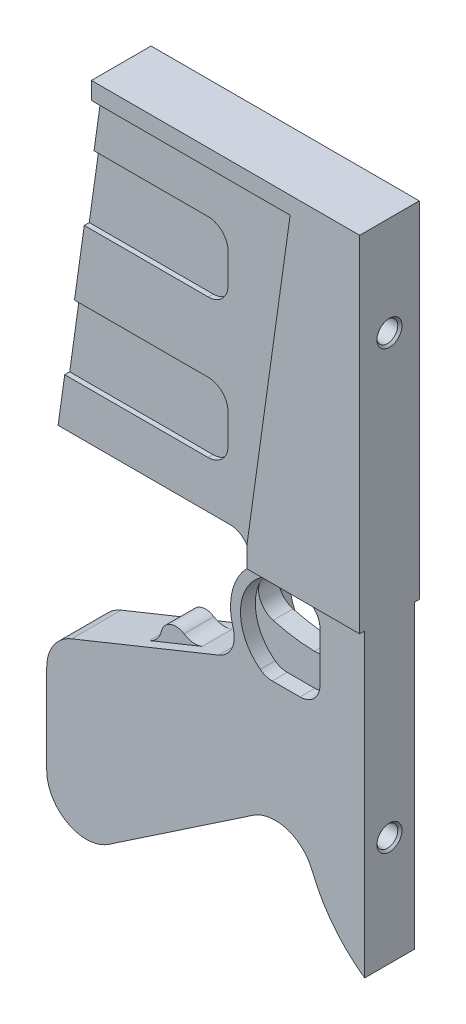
ISO-10303-21;
HEADER;
FILE_DESCRIPTION(('STEP AP214'),'2;1');
FILE_NAME('part.step','',(''),(''),'','','');
FILE_SCHEMA(('AUTOMOTIVE_DESIGN { 1 0 10303 214 1 1 1 1 }'));
ENDSEC;
DATA;
#1=APPLICATION_CONTEXT('core data for automotive mechanical design processes');
#2=APPLICATION_PROTOCOL_DEFINITION('international standard','automotive_design',2000,#1);
#3=PRODUCT_CONTEXT('',#1,'mechanical');
#4=PRODUCT('Part','Part','',(#3));
#5=PRODUCT_RELATED_PRODUCT_CATEGORY('part','',(#4));
#6=PRODUCT_DEFINITION_FORMATION('','',#4);
#7=PRODUCT_DEFINITION_CONTEXT('part definition',#1,'design');
#8=PRODUCT_DEFINITION('design','',#6,#7);
#9=PRODUCT_DEFINITION_SHAPE('','',#8);
#10=(LENGTH_UNIT() NAMED_UNIT(*) SI_UNIT(.MILLI.,.METRE.));
#11=(NAMED_UNIT(*) PLANE_ANGLE_UNIT() SI_UNIT($,.RADIAN.));
#12=(NAMED_UNIT(*) SI_UNIT($,.STERADIAN.) SOLID_ANGLE_UNIT());
#13=UNCERTAINTY_MEASURE_WITH_UNIT(LENGTH_MEASURE(1.E-05),#10,'distance_accuracy_value','');
#14=(GEOMETRIC_REPRESENTATION_CONTEXT(3) GLOBAL_UNCERTAINTY_ASSIGNED_CONTEXT((#13)) GLOBAL_UNIT_ASSIGNED_CONTEXT((#10,
#11,#12)) REPRESENTATION_CONTEXT('',''));
#15=CARTESIAN_POINT('',(0.,0.,0.));
#16=DIRECTION('',(0.,0.,1.));
#17=DIRECTION('',(1.,0.,0.));
#18=AXIS2_PLACEMENT_3D('',#15,#16,#17);
#19=CARTESIAN_POINT('',(-13.,46.5,5.));
#20=DIRECTION('',(0.,0.,-1.));
#21=DIRECTION('',(-1.,0.,0.));
#22=AXIS2_PLACEMENT_3D('',#19,#20,#21);
#23=CYLINDRICAL_SURFACE('',#22,4.);
#24=DIRECTION('',(0.,0.,-1.));
#25=VECTOR('',#24,1.);
#26=CARTESIAN_POINT('',(-13.,42.5,5.));
#27=LINE('',#26,#25);
#28=CARTESIAN_POINT('',(-13.,42.5,-2.));
#29=VERTEX_POINT('',#28);
#30=CARTESIAN_POINT('',(-13.,42.5,-5.));
#31=VERTEX_POINT('',#30);
#32=EDGE_CURVE('E718',#29,#31,#27,.T.);
#33=ORIENTED_EDGE('',*,*,#32,.F.);
#34=CARTESIAN_POINT('',(-13.,46.5,-2.));
#35=DIRECTION('',(0.,0.,1.));
#36=DIRECTION('',(1.,0.,0.));
#37=AXIS2_PLACEMENT_3D('',#34,#35,#36);
#38=CIRCLE('',#37,4.);
#39=CARTESIAN_POINT('',(-9.,46.5,-2.));
#40=VERTEX_POINT('',#39);
#41=EDGE_CURVE('E546',#29,#40,#38,.T.);
#42=ORIENTED_EDGE('',*,*,#41,.T.);
#43=DIRECTION('',(0.,0.,-1.));
#44=VECTOR('',#43,1.);
#45=CARTESIAN_POINT('',(-9.,46.5,5.));
#46=LINE('',#45,#44);
#47=CARTESIAN_POINT('',(-9.,46.5,-5.));
#48=VERTEX_POINT('',#47);
#49=EDGE_CURVE('E722',#40,#48,#46,.T.);
#50=ORIENTED_EDGE('',*,*,#49,.T.);
#51=CARTESIAN_POINT('',(-13.,46.5,-5.));
#52=DIRECTION('',(0.,0.,1.));
#53=DIRECTION('',(1.,0.,0.));
#54=AXIS2_PLACEMENT_3D('',#51,#52,#53);
#55=CIRCLE('',#54,4.);
#56=EDGE_CURVE('E696',#31,#48,#55,.T.);
#57=ORIENTED_EDGE('',*,*,#56,.F.);
#58=EDGE_LOOP('',(#33,#42,#50,#57));
#59=FACE_BOUND('',#58,.T.);
#60=ADVANCED_FACE('F49',(#59),#23,.F.);
#61=CARTESIAN_POINT('',(0.,42.5,5.));
#62=DIRECTION('',(0.,-1.,0.));
#63=DIRECTION('',(0.,0.,-1.));
#64=AXIS2_PLACEMENT_3D('',#61,#62,#63);
#65=PLANE('',#64);
#66=DIRECTION('',(-1.,0.,0.));
#67=VECTOR('',#66,1.);
#68=CARTESIAN_POINT('',(0.,42.5,-2.));
#69=LINE('',#68,#67);
#70=CARTESIAN_POINT('',(-18.6,42.5,-2.));
#71=VERTEX_POINT('',#70);
#72=EDGE_CURVE('E544',#29,#71,#69,.T.);
#73=ORIENTED_EDGE('',*,*,#72,.F.);
#74=ORIENTED_EDGE('',*,*,#32,.T.);
#75=DIRECTION('',(-1.,0.,0.));
#76=VECTOR('',#75,1.);
#77=CARTESIAN_POINT('',(0.,42.5,-5.));
#78=LINE('',#77,#76);
#79=CARTESIAN_POINT('',(-18.6,42.5,-5.));
#80=VERTEX_POINT('',#79);
#81=EDGE_CURVE('E699',#31,#80,#78,.T.);
#82=ORIENTED_EDGE('',*,*,#81,.T.);
#83=DIRECTION('',(0.,0.,-1.));
#84=VECTOR('',#83,1.);
#85=CARTESIAN_POINT('',(-18.6,42.5,5.));
#86=LINE('',#85,#84);
#87=EDGE_CURVE('E714',#71,#80,#86,.T.);
#88=ORIENTED_EDGE('',*,*,#87,.F.);
#89=EDGE_LOOP('',(#73,#74,#82,#88));
#90=FACE_BOUND('',#89,.T.);
#91=ADVANCED_FACE('F1115',(#90),#65,.F.);
#92=CARTESIAN_POINT('',(-18.6,46.5,5.));
#93=DIRECTION('',(0.,0.,-1.));
#94=DIRECTION('',(-1.,0.,0.));
#95=AXIS2_PLACEMENT_3D('',#92,#93,#94);
#96=CYLINDRICAL_SURFACE('',#95,4.);
#97=DIRECTION('',(0.,0.,-1.));
#98=VECTOR('',#97,1.);
#99=CARTESIAN_POINT('',(-21.,43.3,5.));
#100=LINE('',#99,#98);
#101=CARTESIAN_POINT('',(-21.,43.3,-2.));
#102=VERTEX_POINT('',#101);
#103=CARTESIAN_POINT('',(-21.,43.3,-5.));
#104=VERTEX_POINT('',#103);
#105=EDGE_CURVE('E709',#102,#104,#100,.T.);
#106=ORIENTED_EDGE('',*,*,#105,.F.);
#107=CARTESIAN_POINT('',(-18.6,46.5,-2.));
#108=DIRECTION('',(0.,0.,1.));
#109=DIRECTION('',(1.,0.,0.));
#110=AXIS2_PLACEMENT_3D('',#107,#108,#109);
#111=CIRCLE('',#110,4.);
#112=EDGE_CURVE('E65',#102,#71,#111,.T.);
#113=ORIENTED_EDGE('',*,*,#112,.T.);
#114=ORIENTED_EDGE('',*,*,#87,.T.);
#115=CARTESIAN_POINT('',(-18.6,46.5,-5.));
#116=DIRECTION('',(0.,0.,1.));
#117=DIRECTION('',(1.,0.,0.));
#118=AXIS2_PLACEMENT_3D('',#115,#116,#117);
#119=CIRCLE('',#118,4.);
#120=EDGE_CURVE('E702',#104,#80,#119,.T.);
#121=ORIENTED_EDGE('',*,*,#120,.F.);
#122=EDGE_LOOP('',(#106,#113,#114,#121));
#123=FACE_BOUND('',#122,.T.);
#124=ADVANCED_FACE('F1123',(#123),#96,.F.);
#125=CARTESIAN_POINT('',(0.,60.5,6.));
#126=DIRECTION('',(0.,-1.,0.));
#127=DIRECTION('',(1.,0.,0.));
#128=AXIS2_PLACEMENT_3D('',#125,#126,#127);
#129=PLANE('',#128);
#130=DIRECTION('',(0.,0.,-1.));
#131=VECTOR('',#130,1.);
#132=CARTESIAN_POINT('',(0.,60.5,6.));
#133=LINE('',#132,#131);
#134=CARTESIAN_POINT('',(0.,60.5,-5.));
#135=VERTEX_POINT('',#134);
#136=CARTESIAN_POINT('',(0.,60.5,-6.));
#137=VERTEX_POINT('',#136);
#138=EDGE_CURVE('E1003',#135,#137,#133,.T.);
#139=ORIENTED_EDGE('',*,*,#138,.F.);
#140=DIRECTION('',(-1.,0.,0.));
#141=VECTOR('',#140,1.);
#142=CARTESIAN_POINT('',(0.,60.5,-5.));
#143=LINE('',#142,#141);
#144=CARTESIAN_POINT('',(-22.7147321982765,60.5,-5.));
#145=VERTEX_POINT('',#144);
#146=EDGE_CURVE('E596',#135,#145,#143,.T.);
#147=ORIENTED_EDGE('',*,*,#146,.T.);
#148=DIRECTION('',(0.,0.,-1.));
#149=VECTOR('',#148,1.);
#150=CARTESIAN_POINT('',(-22.7147321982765,60.5,6.));
#151=LINE('',#150,#149);
#152=CARTESIAN_POINT('',(-22.7147321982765,60.5,-6.));
#153=VERTEX_POINT('',#152);
#154=EDGE_CURVE('E1007',#145,#153,#151,.T.);
#155=ORIENTED_EDGE('',*,*,#154,.T.);
#156=DIRECTION('',(-1.,0.,0.));
#157=VECTOR('',#156,1.);
#158=CARTESIAN_POINT('',(0.,60.5,-6.));
#159=LINE('',#158,#157);
#160=EDGE_CURVE('E997',#137,#153,#159,.T.);
#161=ORIENTED_EDGE('',*,*,#160,.F.);
#162=EDGE_LOOP('',(#139,#147,#155,#161));
#163=FACE_BOUND('',#162,.T.);
#164=ADVANCED_FACE('F1197',(#163),#129,.T.);
#165=DIRECTION('',(0.,0.,-1.));
#166=VECTOR('',#165,1.);
#167=CARTESIAN_POINT('',(-22.7147321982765,60.5,5.));
#168=LINE('',#167,#166);
#169=CARTESIAN_POINT('',(-22.7147321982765,60.5,4.));
#170=VERTEX_POINT('',#169);
#171=CARTESIAN_POINT('',(-22.7147321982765,60.5,-4.));
#172=VERTEX_POINT('',#171);
#173=EDGE_CURVE('E11',#170,#172,#168,.T.);
#174=ORIENTED_EDGE('',*,*,#173,.F.);
#175=DIRECTION('',(-1.,0.,0.));
#176=VECTOR('',#175,1.);
#177=CARTESIAN_POINT('',(0.,60.5,4.));
#178=LINE('',#177,#176);
#179=CARTESIAN_POINT('',(-24.0904545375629,60.5,4.));
#180=VERTEX_POINT('',#179);
#181=EDGE_CURVE('E816',#170,#180,#178,.T.);
#182=ORIENTED_EDGE('',*,*,#181,.T.);
#183=DIRECTION('',(0.,0.,-1.));
#184=VECTOR('',#183,1.);
#185=CARTESIAN_POINT('',(-24.0904545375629,60.5,4.));
#186=LINE('',#185,#184);
#187=CARTESIAN_POINT('',(-24.0904545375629,60.5,-4.));
#188=VERTEX_POINT('',#187);
#189=EDGE_CURVE('E962',#180,#188,#186,.T.);
#190=ORIENTED_EDGE('',*,*,#189,.T.);
#191=DIRECTION('',(-1.,0.,0.));
#192=VECTOR('',#191,1.);
#193=CARTESIAN_POINT('',(0.,60.5,-4.));
#194=LINE('',#193,#192);
#195=EDGE_CURVE('E862',#172,#188,#194,.T.);
#196=ORIENTED_EDGE('',*,*,#195,.F.);
#197=EDGE_LOOP('',(#174,#182,#190,#196));
#198=FACE_BOUND('',#197,.T.);
#199=ADVANCED_FACE('F1052',(#198),#129,.T.);
#200=CARTESIAN_POINT('',(0.,116.,4.));
#201=DIRECTION('',(0.,1.,0.));
#202=DIRECTION('',(0.,0.,1.));
#203=AXIS2_PLACEMENT_3D('',#200,#201,#202);
#204=PLANE('',#203);
#205=DIRECTION('',(1.,0.,0.));
#206=VECTOR('',#205,1.);
#207=CARTESIAN_POINT('',(0.,116.,-3.));
#208=LINE('',#207,#206);
#209=CARTESIAN_POINT('',(-55.4756787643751,116.,-3.));
#210=VERTEX_POINT('',#209);
#211=CARTESIAN_POINT('',(-32.5,116.,-3.));
#212=VERTEX_POINT('',#211);
#213=EDGE_CURVE('E776',#210,#212,#208,.T.);
#214=ORIENTED_EDGE('',*,*,#213,.F.);
#215=DIRECTION('',(0.,0.,-1.));
#216=VECTOR('',#215,1.);
#217=CARTESIAN_POINT('',(-55.4756787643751,116.,4.));
#218=LINE('',#217,#216);
#219=CARTESIAN_POINT('',(-55.4756787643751,116.,-4.));
#220=VERTEX_POINT('',#219);
#221=EDGE_CURVE('E956',#210,#220,#218,.T.);
#222=ORIENTED_EDGE('',*,*,#221,.T.);
#223=DIRECTION('',(1.,0.,0.));
#224=VECTOR('',#223,1.);
#225=CARTESIAN_POINT('',(0.,116.,-4.));
#226=LINE('',#225,#224);
#227=CARTESIAN_POINT('',(-32.5,116.,-4.));
#228=VERTEX_POINT('',#227);
#229=EDGE_CURVE('E874',#220,#228,#226,.T.);
#230=ORIENTED_EDGE('',*,*,#229,.T.);
#231=DIRECTION('',(0.,0.,-1.));
#232=VECTOR('',#231,1.);
#233=CARTESIAN_POINT('',(-32.5,116.,4.));
#234=LINE('',#233,#232);
#235=EDGE_CURVE('E952',#212,#228,#234,.T.);
#236=ORIENTED_EDGE('',*,*,#235,.F.);
#237=EDGE_LOOP('',(#214,#222,#230,#236));
#238=FACE_BOUND('',#237,.T.);
#239=ADVANCED_FACE('F1250',(#238),#204,.F.);
#240=CARTESIAN_POINT('',(-32.5,112.,4.));
#241=DIRECTION('',(0.,0.,-1.));
#242=DIRECTION('',(-1.,0.,0.));
#243=AXIS2_PLACEMENT_3D('',#240,#241,#242);
#244=CYLINDRICAL_SURFACE('',#243,4.);
#245=DIRECTION('',(0.,0.,-1.));
#246=VECTOR('',#245,1.);
#247=CARTESIAN_POINT('',(-28.5,112.,4.));
#248=LINE('',#247,#246);
#249=CARTESIAN_POINT('',(-28.5,112.,-3.));
#250=VERTEX_POINT('',#249);
#251=CARTESIAN_POINT('',(-28.5,112.,-4.));
#252=VERTEX_POINT('',#251);
#253=EDGE_CURVE('E948',#250,#252,#248,.T.);
#254=ORIENTED_EDGE('',*,*,#253,.F.);
#255=CARTESIAN_POINT('',(-32.5,112.,-3.));
#256=DIRECTION('',(0.,0.,1.));
#257=DIRECTION('',(1.,0.,0.));
#258=AXIS2_PLACEMENT_3D('',#255,#256,#257);
#259=CIRCLE('',#258,4.);
#260=EDGE_CURVE('E772',#250,#212,#259,.T.);
#261=ORIENTED_EDGE('',*,*,#260,.T.);
#262=ORIENTED_EDGE('',*,*,#235,.T.);
#263=CARTESIAN_POINT('',(-32.5,112.,-4.));
#264=DIRECTION('',(0.,0.,1.));
#265=DIRECTION('',(1.,0.,0.));
#266=AXIS2_PLACEMENT_3D('',#263,#264,#265);
#267=CIRCLE('',#266,4.);
#268=EDGE_CURVE('E879',#252,#228,#267,.T.);
#269=ORIENTED_EDGE('',*,*,#268,.F.);
#270=EDGE_LOOP('',(#254,#261,#262,#269));
#271=FACE_BOUND('',#270,.T.);
#272=ADVANCED_FACE('F1330',(#271),#244,.F.);
#273=CARTESIAN_POINT('',(-28.5,0.,4.));
#274=DIRECTION('',(1.,0.,0.));
#275=DIRECTION('',(0.,0.,-1.));
#276=AXIS2_PLACEMENT_3D('',#273,#274,#275);
#277=PLANE('',#276);
#278=DIRECTION('',(0.,-1.,0.));
#279=VECTOR('',#278,1.);
#280=CARTESIAN_POINT('',(-28.5,0.,-3.));
#281=LINE('',#280,#279);
#282=CARTESIAN_POINT('',(-28.5,106.,-3.));
#283=VERTEX_POINT('',#282);
#284=EDGE_CURVE('E770',#250,#283,#281,.T.);
#285=ORIENTED_EDGE('',*,*,#284,.F.);
#286=ORIENTED_EDGE('',*,*,#253,.T.);
#287=DIRECTION('',(0.,-1.,0.));
#288=VECTOR('',#287,1.);
#289=CARTESIAN_POINT('',(-28.5,0.,-4.));
#290=LINE('',#289,#288);
#291=CARTESIAN_POINT('',(-28.5,106.,-4.));
#292=VERTEX_POINT('',#291);
#293=EDGE_CURVE('E882',#252,#292,#290,.T.);
#294=ORIENTED_EDGE('',*,*,#293,.T.);
#295=DIRECTION('',(0.,0.,-1.));
#296=VECTOR('',#295,1.);
#297=CARTESIAN_POINT('',(-28.5,106.,4.));
#298=LINE('',#297,#296);
#299=EDGE_CURVE('E944',#283,#292,#298,.T.);
#300=ORIENTED_EDGE('',*,*,#299,.F.);
#301=EDGE_LOOP('',(#285,#286,#294,#300));
#302=FACE_BOUND('',#301,.T.);
#303=ADVANCED_FACE('F1327',(#302),#277,.F.);
#304=CARTESIAN_POINT('',(-32.5,106.,4.));
#305=DIRECTION('',(0.,0.,-1.));
#306=DIRECTION('',(-1.,0.,0.));
#307=AXIS2_PLACEMENT_3D('',#304,#305,#306);
#308=CYLINDRICAL_SURFACE('',#307,4.);
#309=DIRECTION('',(0.,0.,-1.));
#310=VECTOR('',#309,1.);
#311=CARTESIAN_POINT('',(-32.5,102.,4.));
#312=LINE('',#311,#310);
#313=CARTESIAN_POINT('',(-32.5,102.,-3.));
#314=VERTEX_POINT('',#313);
#315=CARTESIAN_POINT('',(-32.5,102.,-4.));
#316=VERTEX_POINT('',#315);
#317=EDGE_CURVE('E940',#314,#316,#312,.T.);
#318=ORIENTED_EDGE('',*,*,#317,.F.);
#319=CARTESIAN_POINT('',(-32.5,106.,-3.));
#320=DIRECTION('',(0.,0.,1.));
#321=DIRECTION('',(1.,0.,0.));
#322=AXIS2_PLACEMENT_3D('',#319,#320,#321);
#323=CIRCLE('',#322,4.);
#324=EDGE_CURVE('E757',#314,#283,#323,.T.);
#325=ORIENTED_EDGE('',*,*,#324,.T.);
#326=ORIENTED_EDGE('',*,*,#299,.T.);
#327=CARTESIAN_POINT('',(-32.5,106.,-4.));
#328=DIRECTION('',(0.,0.,1.));
#329=DIRECTION('',(1.,0.,0.));
#330=AXIS2_PLACEMENT_3D('',#327,#328,#329);
#331=CIRCLE('',#330,4.);
#332=EDGE_CURVE('E885',#316,#292,#331,.T.);
#333=ORIENTED_EDGE('',*,*,#332,.F.);
#334=EDGE_LOOP('',(#318,#325,#326,#333));
#335=FACE_BOUND('',#334,.T.);
#336=ADVANCED_FACE('F1323',(#335),#308,.F.);
#337=CARTESIAN_POINT('',(0.,102.,4.));
#338=DIRECTION('',(0.,-1.,0.));
#339=DIRECTION('',(0.,0.,-1.));
#340=AXIS2_PLACEMENT_3D('',#337,#338,#339);
#341=PLANE('',#340);
#342=DIRECTION('',(-1.,0.,0.));
#343=VECTOR('',#342,1.);
#344=CARTESIAN_POINT('',(0.,102.,-3.));
#345=LINE('',#344,#343);
#346=CARTESIAN_POINT('',(-57.4432504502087,102.,-3.));
#347=VERTEX_POINT('',#346);
#348=EDGE_CURVE('E781',#314,#347,#345,.T.);
#349=ORIENTED_EDGE('',*,*,#348,.F.);
#350=ORIENTED_EDGE('',*,*,#317,.T.);
#351=DIRECTION('',(-1.,0.,0.));
#352=VECTOR('',#351,1.);
#353=CARTESIAN_POINT('',(0.,102.,-4.));
#354=LINE('',#353,#352);
#355=CARTESIAN_POINT('',(-57.4432504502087,102.,-4.));
#356=VERTEX_POINT('',#355);
#357=EDGE_CURVE('E888',#316,#356,#354,.T.);
#358=ORIENTED_EDGE('',*,*,#357,.T.);
#359=DIRECTION('',(0.,0.,-1.));
#360=VECTOR('',#359,1.);
#361=CARTESIAN_POINT('',(-57.4432504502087,102.,4.));
#362=LINE('',#361,#360);
#363=EDGE_CURVE('E936',#347,#356,#362,.T.);
#364=ORIENTED_EDGE('',*,*,#363,.F.);
#365=EDGE_LOOP('',(#349,#350,#358,#364));
#366=FACE_BOUND('',#365,.T.);
#367=ADVANCED_FACE('F1319',(#366),#341,.F.);
#368=CARTESIAN_POINT('',(0.,88.,4.));
#369=DIRECTION('',(0.,1.,0.));
#370=DIRECTION('',(-1.,0.,0.));
#371=AXIS2_PLACEMENT_3D('',#368,#369,#370);
#372=PLANE('',#371);
#373=DIRECTION('',(1.,0.,0.));
#374=VECTOR('',#373,1.);
#375=CARTESIAN_POINT('',(0.,88.,-3.));
#376=LINE('',#375,#374);
#377=CARTESIAN_POINT('',(-59.4108221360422,88.,-3.));
#378=VERTEX_POINT('',#377);
#379=CARTESIAN_POINT('',(-32.5,88.,-3.));
#380=VERTEX_POINT('',#379);
#381=EDGE_CURVE('E804',#378,#380,#376,.T.);
#382=ORIENTED_EDGE('',*,*,#381,.F.);
#383=DIRECTION('',(0.,0.,-1.));
#384=VECTOR('',#383,1.);
#385=CARTESIAN_POINT('',(-59.4108221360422,88.,4.));
#386=LINE('',#385,#384);
#387=CARTESIAN_POINT('',(-59.4108221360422,88.,-4.));
#388=VERTEX_POINT('',#387);
#389=EDGE_CURVE('E932',#378,#388,#386,.T.);
#390=ORIENTED_EDGE('',*,*,#389,.T.);
#391=DIRECTION('',(1.,0.,0.));
#392=VECTOR('',#391,1.);
#393=CARTESIAN_POINT('',(0.,88.,-4.));
#394=LINE('',#393,#392);
#395=CARTESIAN_POINT('',(-32.5,88.,-4.));
#396=VERTEX_POINT('',#395);
#397=EDGE_CURVE('E891',#388,#396,#394,.T.);
#398=ORIENTED_EDGE('',*,*,#397,.T.);
#399=DIRECTION('',(0.,0.,-1.));
#400=VECTOR('',#399,1.);
#401=CARTESIAN_POINT('',(-32.5,88.,4.));
#402=LINE('',#401,#400);
#403=EDGE_CURVE('E928',#380,#396,#402,.T.);
#404=ORIENTED_EDGE('',*,*,#403,.F.);
#405=EDGE_LOOP('',(#382,#390,#398,#404));
#406=FACE_BOUND('',#405,.T.);
#407=ADVANCED_FACE('F1082',(#406),#372,.F.);
#408=CARTESIAN_POINT('',(-32.5,84.,4.));
#409=DIRECTION('',(0.,0.,-1.));
#410=DIRECTION('',(-1.,0.,0.));
#411=AXIS2_PLACEMENT_3D('',#408,#409,#410);
#412=CYLINDRICAL_SURFACE('',#411,4.);
#413=DIRECTION('',(0.,0.,-1.));
#414=VECTOR('',#413,1.);
#415=CARTESIAN_POINT('',(-28.5,84.,4.));
#416=LINE('',#415,#414);
#417=CARTESIAN_POINT('',(-28.5,84.,-3.));
#418=VERTEX_POINT('',#417);
#419=CARTESIAN_POINT('',(-28.5,84.,-4.));
#420=VERTEX_POINT('',#419);
#421=EDGE_CURVE('E924',#418,#420,#416,.T.);
#422=ORIENTED_EDGE('',*,*,#421,.F.);
#423=CARTESIAN_POINT('',(-32.5,84.,-3.));
#424=DIRECTION('',(0.,0.,1.));
#425=DIRECTION('',(1.,0.,0.));
#426=AXIS2_PLACEMENT_3D('',#423,#424,#425);
#427=CIRCLE('',#426,4.);
#428=EDGE_CURVE('E801',#418,#380,#427,.T.);
#429=ORIENTED_EDGE('',*,*,#428,.T.);
#430=ORIENTED_EDGE('',*,*,#403,.T.);
#431=CARTESIAN_POINT('',(-32.5,84.,-4.));
#432=DIRECTION('',(0.,0.,1.));
#433=DIRECTION('',(1.,0.,0.));
#434=AXIS2_PLACEMENT_3D('',#431,#432,#433);
#435=CIRCLE('',#434,4.);
#436=EDGE_CURVE('E894',#420,#396,#435,.T.);
#437=ORIENTED_EDGE('',*,*,#436,.F.);
#438=EDGE_LOOP('',(#422,#429,#430,#437));
#439=FACE_BOUND('',#438,.T.);
#440=ADVANCED_FACE('F1088',(#439),#412,.F.);
#441=CARTESIAN_POINT('',(-28.5,0.,4.));
#442=DIRECTION('',(1.,0.,0.));
#443=DIRECTION('',(0.,0.,-1.));
#444=AXIS2_PLACEMENT_3D('',#441,#442,#443);
#445=PLANE('',#444);
#446=DIRECTION('',(0.,-1.,0.));
#447=VECTOR('',#446,1.);
#448=CARTESIAN_POINT('',(-28.5,0.,-3.));
#449=LINE('',#448,#447);
#450=CARTESIAN_POINT('',(-28.5,78.,-3.));
#451=VERTEX_POINT('',#450);
#452=EDGE_CURVE('E732',#418,#451,#449,.T.);
#453=ORIENTED_EDGE('',*,*,#452,.F.);
#454=ORIENTED_EDGE('',*,*,#421,.T.);
#455=DIRECTION('',(0.,-1.,0.));
#456=VECTOR('',#455,1.);
#457=CARTESIAN_POINT('',(-28.5,0.,-4.));
#458=LINE('',#457,#456);
#459=CARTESIAN_POINT('',(-28.5,78.,-4.));
#460=VERTEX_POINT('',#459);
#461=EDGE_CURVE('E897',#420,#460,#458,.T.);
#462=ORIENTED_EDGE('',*,*,#461,.T.);
#463=DIRECTION('',(0.,0.,-1.));
#464=VECTOR('',#463,1.);
#465=CARTESIAN_POINT('',(-28.5,78.,4.));
#466=LINE('',#465,#464);
#467=EDGE_CURVE('E920',#451,#460,#466,.T.);
#468=ORIENTED_EDGE('',*,*,#467,.F.);
#469=EDGE_LOOP('',(#453,#454,#462,#468));
#470=FACE_BOUND('',#469,.T.);
#471=ADVANCED_FACE('F1090',(#470),#445,.F.);
#472=CARTESIAN_POINT('',(-32.5,78.,4.));
#473=DIRECTION('',(0.,0.,-1.));
#474=DIRECTION('',(-1.,0.,0.));
#475=AXIS2_PLACEMENT_3D('',#472,#473,#474);
#476=CYLINDRICAL_SURFACE('',#475,4.);
#477=DIRECTION('',(0.,0.,-1.));
#478=VECTOR('',#477,1.);
#479=CARTESIAN_POINT('',(-32.5,74.,4.));
#480=LINE('',#479,#478);
#481=CARTESIAN_POINT('',(-32.5,74.,-3.));
#482=VERTEX_POINT('',#481);
#483=CARTESIAN_POINT('',(-32.5,74.,-4.));
#484=VERTEX_POINT('',#483);
#485=EDGE_CURVE('E916',#482,#484,#480,.T.);
#486=ORIENTED_EDGE('',*,*,#485,.F.);
#487=CARTESIAN_POINT('',(-32.5,78.,-3.));
#488=DIRECTION('',(0.,0.,1.));
#489=DIRECTION('',(1.,0.,0.));
#490=AXIS2_PLACEMENT_3D('',#487,#488,#489);
#491=CIRCLE('',#490,4.);
#492=EDGE_CURVE('E789',#482,#451,#491,.T.);
#493=ORIENTED_EDGE('',*,*,#492,.T.);
#494=ORIENTED_EDGE('',*,*,#467,.T.);
#495=CARTESIAN_POINT('',(-32.5,78.,-4.));
#496=DIRECTION('',(0.,0.,1.));
#497=DIRECTION('',(1.,0.,0.));
#498=AXIS2_PLACEMENT_3D('',#495,#496,#497);
#499=CIRCLE('',#498,4.);
#500=EDGE_CURVE('E900',#484,#460,#499,.T.);
#501=ORIENTED_EDGE('',*,*,#500,.F.);
#502=EDGE_LOOP('',(#486,#493,#494,#501));
#503=FACE_BOUND('',#502,.T.);
#504=ADVANCED_FACE('F1095',(#503),#476,.F.);
#505=CARTESIAN_POINT('',(0.,74.,4.));
#506=DIRECTION('',(0.,-1.,0.));
#507=DIRECTION('',(1.,0.,0.));
#508=AXIS2_PLACEMENT_3D('',#505,#506,#507);
#509=PLANE('',#508);
#510=DIRECTION('',(-1.,0.,0.));
#511=VECTOR('',#510,1.);
#512=CARTESIAN_POINT('',(0.,74.,-3.));
#513=LINE('',#512,#511);
#514=CARTESIAN_POINT('',(-61.3783938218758,74.,-3.));
#515=VERTEX_POINT('',#514);
#516=EDGE_CURVE('E809',#482,#515,#513,.T.);
#517=ORIENTED_EDGE('',*,*,#516,.F.);
#518=ORIENTED_EDGE('',*,*,#485,.T.);
#519=DIRECTION('',(-1.,0.,0.));
#520=VECTOR('',#519,1.);
#521=CARTESIAN_POINT('',(0.,74.,-4.));
#522=LINE('',#521,#520);
#523=CARTESIAN_POINT('',(-61.3783938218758,74.,-4.));
#524=VERTEX_POINT('',#523);
#525=EDGE_CURVE('E903',#484,#524,#522,.T.);
#526=ORIENTED_EDGE('',*,*,#525,.T.);
#527=DIRECTION('',(0.,0.,-1.));
#528=VECTOR('',#527,1.);
#529=CARTESIAN_POINT('',(-61.3783938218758,74.,4.));
#530=LINE('',#529,#528);
#531=EDGE_CURVE('E912',#515,#524,#530,.T.);
#532=ORIENTED_EDGE('',*,*,#531,.F.);
#533=EDGE_LOOP('',(#517,#518,#526,#532));
#534=FACE_BOUND('',#533,.T.);
#535=ADVANCED_FACE('F1098',(#534),#509,.F.);
#536=CARTESIAN_POINT('',(0.,126.5,6.));
#537=DIRECTION('',(0.,1.,0.));
#538=DIRECTION('',(0.,0.,1.));
#539=AXIS2_PLACEMENT_3D('',#536,#537,#538);
#540=PLANE('',#539);
#541=DIRECTION('',(1.,0.,0.));
#542=VECTOR('',#541,1.);
#543=CARTESIAN_POINT('',(0.,126.5,-4.));
#544=LINE('',#543,#542);
#545=CARTESIAN_POINT('',(-54.,126.5,-4.));
#546=VERTEX_POINT('',#545);
#547=CARTESIAN_POINT('',(-14.,126.5,-4.));
#548=VERTEX_POINT('',#547);
#549=EDGE_CURVE('E869',#546,#548,#544,.T.);
#550=ORIENTED_EDGE('',*,*,#549,.F.);
#551=DIRECTION('',(0.,0.,-1.));
#552=VECTOR('',#551,1.);
#553=CARTESIAN_POINT('',(-54.,126.5,6.));
#554=LINE('',#553,#552);
#555=CARTESIAN_POINT('',(-54.,126.5,-6.));
#556=VERTEX_POINT('',#555);
#557=EDGE_CURVE('E1017',#546,#556,#554,.T.);
#558=ORIENTED_EDGE('',*,*,#557,.T.);
#559=DIRECTION('',(1.,0.,0.));
#560=VECTOR('',#559,1.);
#561=CARTESIAN_POINT('',(0.,126.5,-6.));
#562=LINE('',#561,#560);
#563=CARTESIAN_POINT('',(-14.,126.5,-6.));
#564=VERTEX_POINT('',#563);
#565=EDGE_CURVE('E988',#556,#564,#562,.T.);
#566=ORIENTED_EDGE('',*,*,#565,.T.);
#567=DIRECTION('',(0.,0.,-1.));
#568=VECTOR('',#567,1.);
#569=CARTESIAN_POINT('',(-14.,126.5,6.));
#570=LINE('',#569,#568);
#571=EDGE_CURVE('E1014',#548,#564,#570,.T.);
#572=ORIENTED_EDGE('',*,*,#571,.F.);
#573=EDGE_LOOP('',(#550,#558,#566,#572));
#574=FACE_BOUND('',#573,.T.);
#575=ADVANCED_FACE('F1027',(#574),#540,.F.);
#576=CARTESIAN_POINT('',(-31.1628946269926,4.37965922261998,6.));
#577=DIRECTION('',(0.990268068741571,-0.139173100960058,0.));
#578=DIRECTION('',(0.139173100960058,0.990268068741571,0.));
#579=AXIS2_PLACEMENT_3D('',#576,#577,#578);
#580=PLANE('',#579);
#581=DIRECTION('',(-0.139173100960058,-0.990268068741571,0.));
#582=VECTOR('',#581,1.);
#583=CARTESIAN_POINT('',(-31.1628946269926,4.37965922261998,-4.));
#584=LINE('',#583,#582);
#585=CARTESIAN_POINT('',(-22.7147321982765,64.4914583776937,-4.));
#586=VERTEX_POINT('',#585);
#587=EDGE_CURVE('E867',#548,#586,#584,.T.);
#588=ORIENTED_EDGE('',*,*,#587,.F.);
#589=ORIENTED_EDGE('',*,*,#571,.T.);
#590=DIRECTION('',(-0.139173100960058,-0.990268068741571,0.));
#591=VECTOR('',#590,1.);
#592=CARTESIAN_POINT('',(-31.1628946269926,4.37965922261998,-6.));
#593=LINE('',#592,#591);
#594=CARTESIAN_POINT('',(-22.7147321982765,64.4914583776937,-6.));
#595=VERTEX_POINT('',#594);
#596=EDGE_CURVE('E991',#564,#595,#593,.T.);
#597=ORIENTED_EDGE('',*,*,#596,.T.);
#598=DIRECTION('',(0.,0.,-1.));
#599=VECTOR('',#598,1.);
#600=CARTESIAN_POINT('',(-22.7147321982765,64.4914583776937,6.));
#601=LINE('',#600,#599);
#602=EDGE_CURVE('E1010',#586,#595,#601,.T.);
#603=ORIENTED_EDGE('',*,*,#602,.F.);
#604=EDGE_LOOP('',(#588,#589,#597,#603));
#605=FACE_BOUND('',#604,.T.);
#606=ADVANCED_FACE('F1042',(#605),#580,.F.);
#607=CARTESIAN_POINT('',(0.,130.,6.));
#608=DIRECTION('',(0.,-1.,0.));
#609=DIRECTION('',(0.,0.,-1.));
#610=AXIS2_PLACEMENT_3D('',#607,#608,#609);
#611=PLANE('',#610);
#612=DIRECTION('',(-1.,0.,0.));
#613=VECTOR('',#612,1.);
#614=CARTESIAN_POINT('',(0.,130.,-6.));
#615=LINE('',#614,#613);
#616=CARTESIAN_POINT('',(0.,130.,-6.));
#617=VERTEX_POINT('',#616);
#618=CARTESIAN_POINT('',(-54.,130.,-6.));
#619=VERTEX_POINT('',#618);
#620=EDGE_CURVE('E964',#617,#619,#615,.T.);
#621=ORIENTED_EDGE('',*,*,#620,.T.);
#622=DIRECTION('',(0.,0.,-1.));
#623=VECTOR('',#622,1.);
#624=CARTESIAN_POINT('',(-54.,130.,6.));
#625=LINE('',#624,#623);
#626=CARTESIAN_POINT('',(-54.,130.,6.));
#627=VERTEX_POINT('',#626);
#628=EDGE_CURVE('E53',#627,#619,#625,.T.);
#629=ORIENTED_EDGE('',*,*,#628,.F.);
#630=DIRECTION('',(-1.,0.,0.));
#631=VECTOR('',#630,1.);
#632=CARTESIAN_POINT('',(0.,130.,6.));
#633=LINE('',#632,#631);
#634=CARTESIAN_POINT('',(0.,130.,6.));
#635=VERTEX_POINT('',#634);
#636=EDGE_CURVE('E965',#635,#627,#633,.T.);
#637=ORIENTED_EDGE('',*,*,#636,.F.);
#638=DIRECTION('',(0.,0.,-1.));
#639=VECTOR('',#638,1.);
#640=CARTESIAN_POINT('',(0.,130.,6.));
#641=LINE('',#640,#639);
#642=EDGE_CURVE('E982',#635,#617,#641,.T.);
#643=ORIENTED_EDGE('',*,*,#642,.T.);
#644=EDGE_LOOP('',(#621,#629,#637,#643));
#645=FACE_BOUND('',#644,.T.);
#646=ADVANCED_FACE('F51',(#645),#611,.F.);
#647=CARTESIAN_POINT('',(-54.,0.,6.));
#648=DIRECTION('',(1.,0.,0.));
#649=DIRECTION('',(0.,0.,-1.));
#650=AXIS2_PLACEMENT_3D('',#647,#648,#649);
#651=PLANE('',#650);
#652=DIRECTION('',(0.,-1.,0.));
#653=VECTOR('',#652,1.);
#654=CARTESIAN_POINT('',(-54.,0.,-6.));
#655=LINE('',#654,#653);
#656=EDGE_CURVE('E985',#619,#556,#655,.T.);
#657=ORIENTED_EDGE('',*,*,#656,.T.);
#658=ORIENTED_EDGE('',*,*,#557,.F.);
#659=DIRECTION('',(0.,0.,-1.));
#660=VECTOR('',#659,1.);
#661=CARTESIAN_POINT('',(-54.,126.5,4.));
#662=LINE('',#661,#660);
#663=CARTESIAN_POINT('',(-54.,126.5,4.));
#664=VERTEX_POINT('',#663);
#665=EDGE_CURVE('E960',#664,#546,#662,.T.);
#666=ORIENTED_EDGE('',*,*,#665,.F.);
#667=CARTESIAN_POINT('',(-54.,126.5,6.));
#668=VERTEX_POINT('',#667);
#669=EDGE_CURVE('E1018',#668,#664,#554,.T.);
#670=ORIENTED_EDGE('',*,*,#669,.F.);
#671=DIRECTION('',(0.,-1.,0.));
#672=VECTOR('',#671,1.);
#673=CARTESIAN_POINT('',(-54.,0.,6.));
#674=LINE('',#673,#672);
#675=EDGE_CURVE('E968',#627,#668,#674,.T.);
#676=ORIENTED_EDGE('',*,*,#675,.F.);
#677=ORIENTED_EDGE('',*,*,#628,.T.);
#678=EDGE_LOOP('',(#657,#658,#666,#670,#676,#677));
#679=FACE_BOUND('',#678,.T.);
#680=ADVANCED_FACE('F1033',(#679),#651,.F.);
#681=ORIENTED_EDGE('',*,*,#669,.T.);
#682=DIRECTION('',(1.,0.,0.));
#683=VECTOR('',#682,1.);
#684=CARTESIAN_POINT('',(0.,126.5,4.));
#685=LINE('',#684,#683);
#686=CARTESIAN_POINT('',(-14.,126.5,4.));
#687=VERTEX_POINT('',#686);
#688=EDGE_CURVE('E826',#664,#687,#685,.T.);
#689=ORIENTED_EDGE('',*,*,#688,.T.);
#690=CARTESIAN_POINT('',(-14.,126.5,6.));
#691=VERTEX_POINT('',#690);
#692=EDGE_CURVE('E1015',#691,#687,#570,.T.);
#693=ORIENTED_EDGE('',*,*,#692,.F.);
#694=DIRECTION('',(1.,0.,0.));
#695=VECTOR('',#694,1.);
#696=CARTESIAN_POINT('',(0.,126.5,6.));
#697=LINE('',#696,#695);
#698=EDGE_CURVE('E971',#668,#691,#697,.T.);
#699=ORIENTED_EDGE('',*,*,#698,.F.);
#700=EDGE_LOOP('',(#681,#689,#693,#699));
#701=FACE_BOUND('',#700,.T.);
#702=ADVANCED_FACE('F1108',(#701),#540,.F.);
#703=ORIENTED_EDGE('',*,*,#692,.T.);
#704=DIRECTION('',(-0.139173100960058,-0.990268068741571,0.));
#705=VECTOR('',#704,1.);
#706=CARTESIAN_POINT('',(-31.1628946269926,4.37965922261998,4.));
#707=LINE('',#706,#705);
#708=CARTESIAN_POINT('',(-22.7147321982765,64.4914583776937,4.));
#709=VERTEX_POINT('',#708);
#710=EDGE_CURVE('E823',#687,#709,#707,.T.);
#711=ORIENTED_EDGE('',*,*,#710,.T.);
#712=CARTESIAN_POINT('',(-22.7147321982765,64.4914583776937,6.));
#713=VERTEX_POINT('',#712);
#714=EDGE_CURVE('E1011',#713,#709,#601,.T.);
#715=ORIENTED_EDGE('',*,*,#714,.F.);
#716=DIRECTION('',(-0.139173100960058,-0.990268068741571,0.));
#717=VECTOR('',#716,1.);
#718=CARTESIAN_POINT('',(-31.1628946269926,4.37965922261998,6.));
#719=LINE('',#718,#717);
#720=EDGE_CURVE('E973',#691,#713,#719,.T.);
#721=ORIENTED_EDGE('',*,*,#720,.F.);
#722=EDGE_LOOP('',(#703,#711,#715,#721));
#723=FACE_BOUND('',#722,.T.);
#724=ADVANCED_FACE('F1272',(#723),#580,.F.);
#725=CARTESIAN_POINT('',(-22.7147321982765,0.,6.));
#726=DIRECTION('',(1.,0.,0.));
#727=DIRECTION('',(0.,0.,-1.));
#728=AXIS2_PLACEMENT_3D('',#725,#726,#727);
#729=PLANE('',#728);
#730=ORIENTED_EDGE('',*,*,#714,.T.);
#731=DIRECTION('',(0.,-1.,0.));
#732=VECTOR('',#731,1.);
#733=CARTESIAN_POINT('',(-22.7147321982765,0.,4.));
#734=LINE('',#733,#732);
#735=EDGE_CURVE('E820',#709,#170,#734,.T.);
#736=ORIENTED_EDGE('',*,*,#735,.T.);
#737=ORIENTED_EDGE('',*,*,#173,.T.);
#738=DIRECTION('',(0.,-1.,0.));
#739=VECTOR('',#738,1.);
#740=CARTESIAN_POINT('',(-22.7147321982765,0.,-4.));
#741=LINE('',#740,#739);
#742=EDGE_CURVE('E865',#586,#172,#741,.T.);
#743=ORIENTED_EDGE('',*,*,#742,.F.);
#744=ORIENTED_EDGE('',*,*,#602,.T.);
#745=DIRECTION('',(0.,-1.,0.));
#746=VECTOR('',#745,1.);
#747=CARTESIAN_POINT('',(-22.7147321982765,0.,-6.));
#748=LINE('',#747,#746);
#749=EDGE_CURVE('E994',#595,#153,#748,.T.);
#750=ORIENTED_EDGE('',*,*,#749,.T.);
#751=ORIENTED_EDGE('',*,*,#154,.F.);
#752=DIRECTION('',(0.,-1.,0.));
#753=VECTOR('',#752,1.);
#754=CARTESIAN_POINT('',(-22.7147321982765,0.,-5.));
#755=LINE('',#754,#753);
#756=CARTESIAN_POINT('',(-22.7147321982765,60.4914583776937,-5.));
#757=VERTEX_POINT('',#756);
#758=EDGE_CURVE('E653',#145,#757,#755,.T.);
#759=ORIENTED_EDGE('',*,*,#758,.T.);
#760=DIRECTION('',(0.,0.,-1.));
#761=VECTOR('',#760,1.);
#762=CARTESIAN_POINT('',(-22.7147321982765,60.4914583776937,5.));
#763=LINE('',#762,#761);
#764=CARTESIAN_POINT('',(-22.7147321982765,60.4914583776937,5.));
#765=VERTEX_POINT('',#764);
#766=EDGE_CURVE('E710',#765,#757,#763,.T.);
#767=ORIENTED_EDGE('',*,*,#766,.F.);
#768=DIRECTION('',(0.,-1.,0.));
#769=VECTOR('',#768,1.);
#770=CARTESIAN_POINT('',(-22.7147321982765,0.,5.));
#771=LINE('',#770,#769);
#772=CARTESIAN_POINT('',(-22.7147321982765,60.5,5.));
#773=VERTEX_POINT('',#772);
#774=EDGE_CURVE('E600',#773,#765,#771,.T.);
#775=ORIENTED_EDGE('',*,*,#774,.F.);
#776=CARTESIAN_POINT('',(-22.7147321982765,60.5,6.));
#777=VERTEX_POINT('',#776);
#778=EDGE_CURVE('E1008',#777,#773,#151,.T.);
#779=ORIENTED_EDGE('',*,*,#778,.F.);
#780=DIRECTION('',(0.,-1.,0.));
#781=VECTOR('',#780,1.);
#782=CARTESIAN_POINT('',(-22.7147321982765,0.,6.));
#783=LINE('',#782,#781);
#784=EDGE_CURVE('E975',#713,#777,#783,.T.);
#785=ORIENTED_EDGE('',*,*,#784,.F.);
#786=EDGE_LOOP('',(#730,#736,#737,#743,#744,#750,#751,#759,#767,#775,#779,#785));
#787=FACE_BOUND('',#786,.T.);
#788=ADVANCED_FACE('F1049',(#787),#729,.F.);
#789=DIRECTION('',(-1.,0.,0.));
#790=VECTOR('',#789,1.);
#791=CARTESIAN_POINT('',(0.,60.5,5.));
#792=LINE('',#791,#790);
#793=CARTESIAN_POINT('',(0.,60.5,5.));
#794=VERTEX_POINT('',#793);
#795=EDGE_CURVE('E597',#794,#773,#792,.T.);
#796=ORIENTED_EDGE('',*,*,#795,.F.);
#797=CARTESIAN_POINT('',(0.,60.5,6.));
#798=VERTEX_POINT('',#797);
#799=EDGE_CURVE('E1004',#798,#794,#133,.T.);
#800=ORIENTED_EDGE('',*,*,#799,.F.);
#801=DIRECTION('',(-1.,0.,0.));
#802=VECTOR('',#801,1.);
#803=CARTESIAN_POINT('',(0.,60.5,6.));
#804=LINE('',#803,#802);
#805=EDGE_CURVE('E977',#798,#777,#804,.T.);
#806=ORIENTED_EDGE('',*,*,#805,.T.);
#807=ORIENTED_EDGE('',*,*,#778,.T.);
#808=EDGE_LOOP('',(#796,#800,#806,#807));
#809=FACE_BOUND('',#808,.T.);
#810=ADVANCED_FACE('F1204',(#809),#129,.T.);
#811=CARTESIAN_POINT('',(0.,0.,6.));
#812=DIRECTION('',(-1.,0.,0.));
#813=DIRECTION('',(0.,0.,1.));
#814=AXIS2_PLACEMENT_3D('',#811,#812,#813);
#815=PLANE('',#814);
#816=CARTESIAN_POINT('',(0.,110.,0.));
#817=DIRECTION('',(1.,0.,0.));
#818=DIRECTION('',(0.,0.,-1.));
#819=AXIS2_PLACEMENT_3D('',#816,#817,#818);
#820=CIRCLE('',#819,2.525);
#821=CARTESIAN_POINT('',(0.,110.,-2.525));
#822=VERTEX_POINT('',#821);
#823=EDGE_CURVE('E509',#822,#822,#820,.T.);
#824=ORIENTED_EDGE('',*,*,#823,.F.);
#825=EDGE_LOOP('',(#824));
#826=FACE_BOUND('',#825,.T.);
#827=CARTESIAN_POINT('',(0.,22.,0.));
#828=DIRECTION('',(1.,0.,0.));
#829=DIRECTION('',(0.,0.,-1.));
#830=AXIS2_PLACEMENT_3D('',#827,#828,#829);
#831=CIRCLE('',#830,2.525);
#832=CARTESIAN_POINT('',(0.,22.,-2.525));
#833=VERTEX_POINT('',#832);
#834=EDGE_CURVE('E502',#833,#833,#831,.T.);
#835=ORIENTED_EDGE('',*,*,#834,.F.);
#836=EDGE_LOOP('',(#835));
#837=FACE_BOUND('',#836,.T.);
#838=DIRECTION('',(0.,1.,0.));
#839=VECTOR('',#838,1.);
#840=CARTESIAN_POINT('',(0.,0.,-6.));
#841=LINE('',#840,#839);
#842=EDGE_CURVE('E969',#137,#617,#841,.T.);
#843=ORIENTED_EDGE('',*,*,#842,.T.);
#844=ORIENTED_EDGE('',*,*,#642,.F.);
#845=DIRECTION('',(0.,1.,0.));
#846=VECTOR('',#845,1.);
#847=CARTESIAN_POINT('',(0.,0.,6.));
#848=LINE('',#847,#846);
#849=EDGE_CURVE('E980',#798,#635,#848,.T.);
#850=ORIENTED_EDGE('',*,*,#849,.F.);
#851=ORIENTED_EDGE('',*,*,#799,.T.);
#852=DIRECTION('',(0.,1.,0.));
#853=VECTOR('',#852,1.);
#854=CARTESIAN_POINT('',(0.,0.,5.));
#855=LINE('',#854,#853);
#856=CARTESIAN_POINT('',(0.,0.,5.));
#857=VERTEX_POINT('',#856);
#858=EDGE_CURVE('E627',#857,#794,#855,.T.);
#859=ORIENTED_EDGE('',*,*,#858,.F.);
#860=DIRECTION('',(0.,0.,-1.));
#861=VECTOR('',#860,1.);
#862=CARTESIAN_POINT('',(0.,0.,5.));
#863=LINE('',#862,#861);
#864=CARTESIAN_POINT('',(0.,0.,-5.));
#865=VERTEX_POINT('',#864);
#866=EDGE_CURVE('E651',#857,#865,#863,.T.);
#867=ORIENTED_EDGE('',*,*,#866,.T.);
#868=DIRECTION('',(0.,1.,0.));
#869=VECTOR('',#868,1.);
#870=CARTESIAN_POINT('',(0.,0.,-5.));
#871=LINE('',#870,#869);
#872=EDGE_CURVE('E681',#865,#135,#871,.T.);
#873=ORIENTED_EDGE('',*,*,#872,.T.);
#874=ORIENTED_EDGE('',*,*,#138,.T.);
#875=EDGE_LOOP('',(#843,#844,#850,#851,#859,#867,#873,#874));
#876=FACE_BOUND('',#875,.T.);
#877=ADVANCED_FACE('F1262',(#826,#837,#876),#815,.F.);
#878=CARTESIAN_POINT('',(0.,0.,6.));
#879=DIRECTION('',(0.,0.,1.));
#880=DIRECTION('',(1.,0.,0.));
#881=AXIS2_PLACEMENT_3D('',#878,#879,#880);
#882=PLANE('',#881);
#883=ORIENTED_EDGE('',*,*,#636,.T.);
#884=ORIENTED_EDGE('',*,*,#675,.T.);
#885=ORIENTED_EDGE('',*,*,#698,.T.);
#886=ORIENTED_EDGE('',*,*,#720,.T.);
#887=ORIENTED_EDGE('',*,*,#784,.T.);
#888=ORIENTED_EDGE('',*,*,#805,.F.);
#889=ORIENTED_EDGE('',*,*,#849,.T.);
#890=EDGE_LOOP('',(#883,#884,#885,#886,#887,#888,#889));
#891=FACE_BOUND('',#890,.T.);
#892=ADVANCED_FACE('F1257',(#891),#882,.T.);
#893=CARTESIAN_POINT('',(0.,0.,-6.));
#894=DIRECTION('',(0.,0.,1.));
#895=DIRECTION('',(1.,0.,0.));
#896=AXIS2_PLACEMENT_3D('',#893,#894,#895);
#897=PLANE('',#896);
#898=ORIENTED_EDGE('',*,*,#620,.F.);
#899=ORIENTED_EDGE('',*,*,#842,.F.);
#900=ORIENTED_EDGE('',*,*,#160,.T.);
#901=ORIENTED_EDGE('',*,*,#749,.F.);
#902=ORIENTED_EDGE('',*,*,#596,.F.);
#903=ORIENTED_EDGE('',*,*,#565,.F.);
#904=ORIENTED_EDGE('',*,*,#656,.F.);
#905=EDGE_LOOP('',(#898,#899,#900,#901,#902,#903,#904));
#906=FACE_BOUND('',#905,.T.);
#907=ADVANCED_FACE('F1037',(#906),#897,.F.);
#908=CARTESIAN_POINT('',(-28.0904545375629,60.5,4.));
#909=DIRECTION('',(0.,0.,-1.));
#910=DIRECTION('',(-1.,0.,0.));
#911=AXIS2_PLACEMENT_3D('',#908,#909,#910);
#912=CYLINDRICAL_SURFACE('',#911,4.);
#913=CARTESIAN_POINT('',(-28.0904545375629,60.5,-4.));
#914=DIRECTION('',(0.,0.,1.));
#915=DIRECTION('',(1.,0.,0.));
#916=AXIS2_PLACEMENT_3D('',#913,#914,#915);
#917=CIRCLE('',#916,4.);
#918=CARTESIAN_POINT('',(-28.0904545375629,64.5,-4.));
#919=VERTEX_POINT('',#918);
#920=EDGE_CURVE('E769',#188,#919,#917,.T.);
#921=ORIENTED_EDGE('',*,*,#920,.F.);
#922=ORIENTED_EDGE('',*,*,#189,.F.);
#923=CARTESIAN_POINT('',(-28.0904545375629,60.5,4.));
#924=DIRECTION('',(0.,0.,1.));
#925=DIRECTION('',(1.,0.,0.));
#926=AXIS2_PLACEMENT_3D('',#923,#924,#925);
#927=CIRCLE('',#926,4.);
#928=CARTESIAN_POINT('',(-28.0904545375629,64.5,4.));
#929=VERTEX_POINT('',#928);
#930=EDGE_CURVE('E813',#180,#929,#927,.T.);
#931=ORIENTED_EDGE('',*,*,#930,.T.);
#932=DIRECTION('',(0.,0.,-1.));
#933=VECTOR('',#932,1.);
#934=CARTESIAN_POINT('',(-28.0904545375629,64.5,4.));
#935=LINE('',#934,#933);
#936=EDGE_CURVE('E859',#929,#919,#935,.T.);
#937=ORIENTED_EDGE('',*,*,#936,.T.);
#938=EDGE_LOOP('',(#921,#922,#931,#937));
#939=FACE_BOUND('',#938,.T.);
#940=ADVANCED_FACE('F1060',(#939),#912,.F.);
#941=CARTESIAN_POINT('',(-70.3881285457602,9.89240633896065,4.));
#942=DIRECTION('',(0.99026806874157,-0.139173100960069,0.));
#943=DIRECTION('',(0.139173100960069,0.99026806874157,0.));
#944=AXIS2_PLACEMENT_3D('',#941,#942,#943);
#945=PLANE('',#944);
#946=DIRECTION('',(-0.139173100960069,-0.99026806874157,0.));
#947=VECTOR('',#946,1.);
#948=CARTESIAN_POINT('',(-70.3881285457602,9.89240633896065,-4.));
#949=LINE('',#948,#947);
#950=EDGE_CURVE('E871',#546,#220,#949,.T.);
#951=ORIENTED_EDGE('',*,*,#950,.T.);
#952=ORIENTED_EDGE('',*,*,#221,.F.);
#953=DIRECTION('',(-0.139173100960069,-0.99026806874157,0.));
#954=VECTOR('',#953,1.);
#955=CARTESIAN_POINT('',(-70.3881285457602,9.89240633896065,-3.));
#956=LINE('',#955,#954);
#957=EDGE_CURVE('E778',#210,#347,#956,.T.);
#958=ORIENTED_EDGE('',*,*,#957,.T.);
#959=ORIENTED_EDGE('',*,*,#363,.T.);
#960=EDGE_CURVE('E876',#356,#388,#949,.T.);
#961=ORIENTED_EDGE('',*,*,#960,.T.);
#962=ORIENTED_EDGE('',*,*,#389,.F.);
#963=DIRECTION('',(-0.139173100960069,-0.99026806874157,0.));
#964=VECTOR('',#963,1.);
#965=CARTESIAN_POINT('',(-70.3881285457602,9.89240633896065,-3.));
#966=LINE('',#965,#964);
#967=EDGE_CURVE('E806',#378,#515,#966,.T.);
#968=ORIENTED_EDGE('',*,*,#967,.T.);
#969=ORIENTED_EDGE('',*,*,#531,.T.);
#970=CARTESIAN_POINT('',(-62.7135317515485,64.5,-4.));
#971=VERTEX_POINT('',#970);
#972=EDGE_CURVE('E875',#524,#971,#949,.T.);
#973=ORIENTED_EDGE('',*,*,#972,.T.);
#974=DIRECTION('',(0.,0.,-1.));
#975=VECTOR('',#974,1.);
#976=CARTESIAN_POINT('',(-62.7135317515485,64.5,4.));
#977=LINE('',#976,#975);
#978=CARTESIAN_POINT('',(-62.7135317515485,64.5,4.));
#979=VERTEX_POINT('',#978);
#980=EDGE_CURVE('E909',#979,#971,#977,.T.);
#981=ORIENTED_EDGE('',*,*,#980,.F.);
#982=DIRECTION('',(-0.139173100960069,-0.99026806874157,0.));
#983=VECTOR('',#982,1.);
#984=CARTESIAN_POINT('',(-70.3881285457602,9.89240633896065,4.));
#985=LINE('',#984,#983);
#986=CARTESIAN_POINT('',(-61.3783938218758,74.,4.));
#987=VERTEX_POINT('',#986);
#988=EDGE_CURVE('E832',#987,#979,#985,.T.);
#989=ORIENTED_EDGE('',*,*,#988,.F.);
#990=CARTESIAN_POINT('',(-61.3783938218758,74.,3.));
#991=VERTEX_POINT('',#990);
#992=EDGE_CURVE('E913',#987,#991,#530,.T.);
#993=ORIENTED_EDGE('',*,*,#992,.T.);
#994=DIRECTION('',(-0.139173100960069,-0.99026806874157,0.));
#995=VECTOR('',#994,1.);
#996=CARTESIAN_POINT('',(-70.3881285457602,9.89240633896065,3.));
#997=LINE('',#996,#995);
#998=CARTESIAN_POINT('',(-59.4108221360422,88.,3.));
#999=VERTEX_POINT('',#998);
#1000=EDGE_CURVE('E794',#999,#991,#997,.T.);
#1001=ORIENTED_EDGE('',*,*,#1000,.F.);
#1002=CARTESIAN_POINT('',(-59.4108221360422,88.,4.));
#1003=VERTEX_POINT('',#1002);
#1004=EDGE_CURVE('E933',#1003,#999,#386,.T.);
#1005=ORIENTED_EDGE('',*,*,#1004,.F.);
#1006=CARTESIAN_POINT('',(-57.4432504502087,102.,4.));
#1007=VERTEX_POINT('',#1006);
#1008=EDGE_CURVE('E833',#1007,#1003,#985,.T.);
#1009=ORIENTED_EDGE('',*,*,#1008,.F.);
#1010=CARTESIAN_POINT('',(-57.4432504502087,102.,3.));
#1011=VERTEX_POINT('',#1010);
#1012=EDGE_CURVE('E937',#1007,#1011,#362,.T.);
#1013=ORIENTED_EDGE('',*,*,#1012,.T.);
#1014=DIRECTION('',(-0.139173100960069,-0.99026806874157,0.));
#1015=VECTOR('',#1014,1.);
#1016=CARTESIAN_POINT('',(-70.3881285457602,9.89240633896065,3.));
#1017=LINE('',#1016,#1015);
#1018=CARTESIAN_POINT('',(-55.4756787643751,116.,3.));
#1019=VERTEX_POINT('',#1018);
#1020=EDGE_CURVE('E762',#1019,#1011,#1017,.T.);
#1021=ORIENTED_EDGE('',*,*,#1020,.F.);
#1022=CARTESIAN_POINT('',(-55.4756787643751,116.,4.));
#1023=VERTEX_POINT('',#1022);
#1024=EDGE_CURVE('E957',#1023,#1019,#218,.T.);
#1025=ORIENTED_EDGE('',*,*,#1024,.F.);
#1026=EDGE_CURVE('E829',#664,#1023,#985,.T.);
#1027=ORIENTED_EDGE('',*,*,#1026,.F.);
#1028=ORIENTED_EDGE('',*,*,#665,.T.);
#1029=EDGE_LOOP('',(#951,#952,#958,#959,#961,#962,#968,#969,#973,#981,#989,#993,#1001,#1005,
#1009,#1013,#1021,#1025,#1027,#1028));
#1030=FACE_BOUND('',#1029,.T.);
#1031=ADVANCED_FACE('F1069',(#1030),#945,.F.);
#1032=ORIENTED_EDGE('',*,*,#1024,.T.);
#1033=DIRECTION('',(1.,0.,0.));
#1034=VECTOR('',#1033,1.);
#1035=CARTESIAN_POINT('',(0.,116.,3.));
#1036=LINE('',#1035,#1034);
#1037=CARTESIAN_POINT('',(-32.5,116.,3.));
#1038=VERTEX_POINT('',#1037);
#1039=EDGE_CURVE('E759',#1019,#1038,#1036,.T.);
#1040=ORIENTED_EDGE('',*,*,#1039,.T.);
#1041=CARTESIAN_POINT('',(-32.5,116.,4.));
#1042=VERTEX_POINT('',#1041);
#1043=EDGE_CURVE('E953',#1042,#1038,#234,.T.);
#1044=ORIENTED_EDGE('',*,*,#1043,.F.);
#1045=DIRECTION('',(1.,0.,0.));
#1046=VECTOR('',#1045,1.);
#1047=CARTESIAN_POINT('',(0.,116.,4.));
#1048=LINE('',#1047,#1046);
#1049=EDGE_CURVE('E831',#1023,#1042,#1048,.T.);
#1050=ORIENTED_EDGE('',*,*,#1049,.F.);
#1051=EDGE_LOOP('',(#1032,#1040,#1044,#1050));
#1052=FACE_BOUND('',#1051,.T.);
#1053=ADVANCED_FACE('F1243',(#1052),#204,.F.);
#1054=CARTESIAN_POINT('',(-32.5,112.,3.));
#1055=DIRECTION('',(0.,0.,1.));
#1056=DIRECTION('',(1.,0.,0.));
#1057=AXIS2_PLACEMENT_3D('',#1054,#1055,#1056);
#1058=CIRCLE('',#1057,4.);
#1059=CARTESIAN_POINT('',(-28.5,112.,3.));
#1060=VERTEX_POINT('',#1059);
#1061=EDGE_CURVE('E756',#1060,#1038,#1058,.T.);
#1062=ORIENTED_EDGE('',*,*,#1061,.F.);
#1063=CARTESIAN_POINT('',(-28.5,112.,4.));
#1064=VERTEX_POINT('',#1063);
#1065=EDGE_CURVE('E949',#1064,#1060,#248,.T.);
#1066=ORIENTED_EDGE('',*,*,#1065,.F.);
#1067=CARTESIAN_POINT('',(-32.5,112.,4.));
#1068=DIRECTION('',(0.,0.,1.));
#1069=DIRECTION('',(1.,0.,0.));
#1070=AXIS2_PLACEMENT_3D('',#1067,#1068,#1069);
#1071=CIRCLE('',#1070,4.);
#1072=EDGE_CURVE('E835',#1064,#1042,#1071,.T.);
#1073=ORIENTED_EDGE('',*,*,#1072,.T.);
#1074=ORIENTED_EDGE('',*,*,#1043,.T.);
#1075=EDGE_LOOP('',(#1062,#1066,#1073,#1074));
#1076=FACE_BOUND('',#1075,.T.);
#1077=ADVANCED_FACE('F1247',(#1076),#244,.F.);
#1078=ORIENTED_EDGE('',*,*,#1065,.T.);
#1079=DIRECTION('',(0.,-1.,0.));
#1080=VECTOR('',#1079,1.);
#1081=CARTESIAN_POINT('',(-28.5,0.,3.));
#1082=LINE('',#1081,#1080);
#1083=CARTESIAN_POINT('',(-28.5,106.,3.));
#1084=VERTEX_POINT('',#1083);
#1085=EDGE_CURVE('E753',#1060,#1084,#1082,.T.);
#1086=ORIENTED_EDGE('',*,*,#1085,.T.);
#1087=CARTESIAN_POINT('',(-28.5,106.,4.));
#1088=VERTEX_POINT('',#1087);
#1089=EDGE_CURVE('E945',#1088,#1084,#298,.T.);
#1090=ORIENTED_EDGE('',*,*,#1089,.F.);
#1091=DIRECTION('',(0.,-1.,0.));
#1092=VECTOR('',#1091,1.);
#1093=CARTESIAN_POINT('',(-28.5,0.,4.));
#1094=LINE('',#1093,#1092);
#1095=EDGE_CURVE('E838',#1064,#1088,#1094,.T.);
#1096=ORIENTED_EDGE('',*,*,#1095,.F.);
#1097=EDGE_LOOP('',(#1078,#1086,#1090,#1096));
#1098=FACE_BOUND('',#1097,.T.);
#1099=ADVANCED_FACE('F1337',(#1098),#277,.F.);
#1100=CARTESIAN_POINT('',(-32.5,106.,3.));
#1101=DIRECTION('',(0.,0.,1.));
#1102=DIRECTION('',(1.,0.,0.));
#1103=AXIS2_PLACEMENT_3D('',#1100,#1101,#1102);
#1104=CIRCLE('',#1103,4.);
#1105=CARTESIAN_POINT('',(-32.5,102.,3.));
#1106=VERTEX_POINT('',#1105);
#1107=EDGE_CURVE('E767',#1106,#1084,#1104,.T.);
#1108=ORIENTED_EDGE('',*,*,#1107,.F.);
#1109=CARTESIAN_POINT('',(-32.5,102.,4.));
#1110=VERTEX_POINT('',#1109);
#1111=EDGE_CURVE('E941',#1110,#1106,#312,.T.);
#1112=ORIENTED_EDGE('',*,*,#1111,.F.);
#1113=CARTESIAN_POINT('',(-32.5,106.,4.));
#1114=DIRECTION('',(0.,0.,1.));
#1115=DIRECTION('',(1.,0.,0.));
#1116=AXIS2_PLACEMENT_3D('',#1113,#1114,#1115);
#1117=CIRCLE('',#1116,4.);
#1118=EDGE_CURVE('E840',#1110,#1088,#1117,.T.);
#1119=ORIENTED_EDGE('',*,*,#1118,.T.);
#1120=ORIENTED_EDGE('',*,*,#1089,.T.);
#1121=EDGE_LOOP('',(#1108,#1112,#1119,#1120));
#1122=FACE_BOUND('',#1121,.T.);
#1123=ADVANCED_FACE('F1343',(#1122),#308,.F.);
#1124=ORIENTED_EDGE('',*,*,#1111,.T.);
#1125=DIRECTION('',(-1.,0.,0.));
#1126=VECTOR('',#1125,1.);
#1127=CARTESIAN_POINT('',(0.,102.,3.));
#1128=LINE('',#1127,#1126);
#1129=EDGE_CURVE('E764',#1106,#1011,#1128,.T.);
#1130=ORIENTED_EDGE('',*,*,#1129,.T.);
#1131=ORIENTED_EDGE('',*,*,#1012,.F.);
#1132=DIRECTION('',(-1.,0.,0.));
#1133=VECTOR('',#1132,1.);
#1134=CARTESIAN_POINT('',(0.,102.,4.));
#1135=LINE('',#1134,#1133);
#1136=EDGE_CURVE('E843',#1110,#1007,#1135,.T.);
#1137=ORIENTED_EDGE('',*,*,#1136,.F.);
#1138=EDGE_LOOP('',(#1124,#1130,#1131,#1137));
#1139=FACE_BOUND('',#1138,.T.);
#1140=ADVANCED_FACE('F1356',(#1139),#341,.F.);
#1141=ORIENTED_EDGE('',*,*,#1004,.T.);
#1142=DIRECTION('',(1.,0.,0.));
#1143=VECTOR('',#1142,1.);
#1144=CARTESIAN_POINT('',(0.,88.,3.));
#1145=LINE('',#1144,#1143);
#1146=CARTESIAN_POINT('',(-32.5,88.,3.));
#1147=VERTEX_POINT('',#1146);
#1148=EDGE_CURVE('E791',#999,#1147,#1145,.T.);
#1149=ORIENTED_EDGE('',*,*,#1148,.T.);
#1150=CARTESIAN_POINT('',(-32.5,88.,4.));
#1151=VERTEX_POINT('',#1150);
#1152=EDGE_CURVE('E929',#1151,#1147,#402,.T.);
#1153=ORIENTED_EDGE('',*,*,#1152,.F.);
#1154=DIRECTION('',(1.,0.,0.));
#1155=VECTOR('',#1154,1.);
#1156=CARTESIAN_POINT('',(0.,88.,4.));
#1157=LINE('',#1156,#1155);
#1158=EDGE_CURVE('E845',#1003,#1151,#1157,.T.);
#1159=ORIENTED_EDGE('',*,*,#1158,.F.);
#1160=EDGE_LOOP('',(#1141,#1149,#1153,#1159));
#1161=FACE_BOUND('',#1160,.T.);
#1162=ADVANCED_FACE('F1368',(#1161),#372,.F.);
#1163=CARTESIAN_POINT('',(-32.5,84.,3.));
#1164=DIRECTION('',(0.,0.,1.));
#1165=DIRECTION('',(1.,0.,0.));
#1166=AXIS2_PLACEMENT_3D('',#1163,#1164,#1165);
#1167=CIRCLE('',#1166,4.);
#1168=CARTESIAN_POINT('',(-28.5,84.,3.));
#1169=VERTEX_POINT('',#1168);
#1170=EDGE_CURVE('E788',#1169,#1147,#1167,.T.);
#1171=ORIENTED_EDGE('',*,*,#1170,.F.);
#1172=CARTESIAN_POINT('',(-28.5,84.,4.));
#1173=VERTEX_POINT('',#1172);
#1174=EDGE_CURVE('E925',#1173,#1169,#416,.T.);
#1175=ORIENTED_EDGE('',*,*,#1174,.F.);
#1176=CARTESIAN_POINT('',(-32.5,84.,4.));
#1177=DIRECTION('',(0.,0.,1.));
#1178=DIRECTION('',(1.,0.,0.));
#1179=AXIS2_PLACEMENT_3D('',#1176,#1177,#1178);
#1180=CIRCLE('',#1179,4.);
#1181=EDGE_CURVE('E847',#1173,#1151,#1180,.T.);
#1182=ORIENTED_EDGE('',*,*,#1181,.T.);
#1183=ORIENTED_EDGE('',*,*,#1152,.T.);
#1184=EDGE_LOOP('',(#1171,#1175,#1182,#1183));
#1185=FACE_BOUND('',#1184,.T.);
#1186=ADVANCED_FACE('F1373',(#1185),#412,.F.);
#1187=ORIENTED_EDGE('',*,*,#1174,.T.);
#1188=DIRECTION('',(0.,-1.,0.));
#1189=VECTOR('',#1188,1.);
#1190=CARTESIAN_POINT('',(-28.5,0.,3.));
#1191=LINE('',#1190,#1189);
#1192=CARTESIAN_POINT('',(-28.5,78.,3.));
#1193=VERTEX_POINT('',#1192);
#1194=EDGE_CURVE('E785',#1169,#1193,#1191,.T.);
#1195=ORIENTED_EDGE('',*,*,#1194,.T.);
#1196=CARTESIAN_POINT('',(-28.5,78.,4.));
#1197=VERTEX_POINT('',#1196);
#1198=EDGE_CURVE('E921',#1197,#1193,#466,.T.);
#1199=ORIENTED_EDGE('',*,*,#1198,.F.);
#1200=DIRECTION('',(0.,-1.,0.));
#1201=VECTOR('',#1200,1.);
#1202=CARTESIAN_POINT('',(-28.5,0.,4.));
#1203=LINE('',#1202,#1201);
#1204=EDGE_CURVE('E850',#1173,#1197,#1203,.T.);
#1205=ORIENTED_EDGE('',*,*,#1204,.F.);
#1206=EDGE_LOOP('',(#1187,#1195,#1199,#1205));
#1207=FACE_BOUND('',#1206,.T.);
#1208=ADVANCED_FACE('F1375',(#1207),#445,.F.);
#1209=CARTESIAN_POINT('',(-32.5,78.,3.));
#1210=DIRECTION('',(0.,0.,1.));
#1211=DIRECTION('',(1.,0.,0.));
#1212=AXIS2_PLACEMENT_3D('',#1209,#1210,#1211);
#1213=CIRCLE('',#1212,4.);
#1214=CARTESIAN_POINT('',(-32.5,74.,3.));
#1215=VERTEX_POINT('',#1214);
#1216=EDGE_CURVE('E773',#1215,#1193,#1213,.T.);
#1217=ORIENTED_EDGE('',*,*,#1216,.F.);
#1218=CARTESIAN_POINT('',(-32.5,74.,4.));
#1219=VERTEX_POINT('',#1218);
#1220=EDGE_CURVE('E917',#1219,#1215,#480,.T.);
#1221=ORIENTED_EDGE('',*,*,#1220,.F.);
#1222=CARTESIAN_POINT('',(-32.5,78.,4.));
#1223=DIRECTION('',(0.,0.,1.));
#1224=DIRECTION('',(1.,0.,0.));
#1225=AXIS2_PLACEMENT_3D('',#1222,#1223,#1224);
#1226=CIRCLE('',#1225,4.);
#1227=EDGE_CURVE('E852',#1219,#1197,#1226,.T.);
#1228=ORIENTED_EDGE('',*,*,#1227,.T.);
#1229=ORIENTED_EDGE('',*,*,#1198,.T.);
#1230=EDGE_LOOP('',(#1217,#1221,#1228,#1229));
#1231=FACE_BOUND('',#1230,.T.);
#1232=ADVANCED_FACE('F1110',(#1231),#476,.F.);
#1233=ORIENTED_EDGE('',*,*,#1220,.T.);
#1234=DIRECTION('',(-1.,0.,0.));
#1235=VECTOR('',#1234,1.);
#1236=CARTESIAN_POINT('',(0.,74.,3.));
#1237=LINE('',#1236,#1235);
#1238=EDGE_CURVE('E796',#1215,#991,#1237,.T.);
#1239=ORIENTED_EDGE('',*,*,#1238,.T.);
#1240=ORIENTED_EDGE('',*,*,#992,.F.);
#1241=DIRECTION('',(-1.,0.,0.));
#1242=VECTOR('',#1241,1.);
#1243=CARTESIAN_POINT('',(0.,74.,4.));
#1244=LINE('',#1243,#1242);
#1245=EDGE_CURVE('E855',#1219,#987,#1244,.T.);
#1246=ORIENTED_EDGE('',*,*,#1245,.F.);
#1247=EDGE_LOOP('',(#1233,#1239,#1240,#1246));
#1248=FACE_BOUND('',#1247,.T.);
#1249=ADVANCED_FACE('F1101',(#1248),#509,.F.);
#1250=CARTESIAN_POINT('',(0.,64.5,4.));
#1251=DIRECTION('',(0.,1.,0.));
#1252=DIRECTION('',(0.,0.,1.));
#1253=AXIS2_PLACEMENT_3D('',#1250,#1251,#1252);
#1254=PLANE('',#1253);
#1255=DIRECTION('',(1.,0.,0.));
#1256=VECTOR('',#1255,1.);
#1257=CARTESIAN_POINT('',(0.,64.5,-4.));
#1258=LINE('',#1257,#1256);
#1259=EDGE_CURVE('E817',#971,#919,#1258,.T.);
#1260=ORIENTED_EDGE('',*,*,#1259,.T.);
#1261=ORIENTED_EDGE('',*,*,#936,.F.);
#1262=DIRECTION('',(1.,0.,0.));
#1263=VECTOR('',#1262,1.);
#1264=CARTESIAN_POINT('',(0.,64.5,4.));
#1265=LINE('',#1264,#1263);
#1266=EDGE_CURVE('E857',#979,#929,#1265,.T.);
#1267=ORIENTED_EDGE('',*,*,#1266,.F.);
#1268=ORIENTED_EDGE('',*,*,#980,.T.);
#1269=EDGE_LOOP('',(#1260,#1261,#1267,#1268));
#1270=FACE_BOUND('',#1269,.T.);
#1271=ADVANCED_FACE('F1065',(#1270),#1254,.F.);
#1272=CARTESIAN_POINT('',(0.,0.,4.));
#1273=DIRECTION('',(0.,0.,1.));
#1274=DIRECTION('',(1.,0.,0.));
#1275=AXIS2_PLACEMENT_3D('',#1272,#1273,#1274);
#1276=PLANE('',#1275);
#1277=ORIENTED_EDGE('',*,*,#930,.F.);
#1278=ORIENTED_EDGE('',*,*,#181,.F.);
#1279=ORIENTED_EDGE('',*,*,#735,.F.);
#1280=ORIENTED_EDGE('',*,*,#710,.F.);
#1281=ORIENTED_EDGE('',*,*,#688,.F.);
#1282=ORIENTED_EDGE('',*,*,#1026,.T.);
#1283=ORIENTED_EDGE('',*,*,#1049,.T.);
#1284=ORIENTED_EDGE('',*,*,#1072,.F.);
#1285=ORIENTED_EDGE('',*,*,#1095,.T.);
#1286=ORIENTED_EDGE('',*,*,#1118,.F.);
#1287=ORIENTED_EDGE('',*,*,#1136,.T.);
#1288=ORIENTED_EDGE('',*,*,#1008,.T.);
#1289=ORIENTED_EDGE('',*,*,#1158,.T.);
#1290=ORIENTED_EDGE('',*,*,#1181,.F.);
#1291=ORIENTED_EDGE('',*,*,#1204,.T.);
#1292=ORIENTED_EDGE('',*,*,#1227,.F.);
#1293=ORIENTED_EDGE('',*,*,#1245,.T.);
#1294=ORIENTED_EDGE('',*,*,#988,.T.);
#1295=ORIENTED_EDGE('',*,*,#1266,.T.);
#1296=EDGE_LOOP('',(#1277,#1278,#1279,#1280,#1281,#1282,#1283,#1284,#1285,#1286,#1287,#1288,
#1289,#1290,#1291,#1292,#1293,#1294,#1295));
#1297=FACE_BOUND('',#1296,.T.);
#1298=ADVANCED_FACE('F1055',(#1297),#1276,.T.);
#1299=CARTESIAN_POINT('',(0.,0.,-4.));
#1300=DIRECTION('',(0.,0.,1.));
#1301=DIRECTION('',(1.,0.,0.));
#1302=AXIS2_PLACEMENT_3D('',#1299,#1300,#1301);
#1303=PLANE('',#1302);
#1304=ORIENTED_EDGE('',*,*,#920,.T.);
#1305=ORIENTED_EDGE('',*,*,#1259,.F.);
#1306=ORIENTED_EDGE('',*,*,#972,.F.);
#1307=ORIENTED_EDGE('',*,*,#525,.F.);
#1308=ORIENTED_EDGE('',*,*,#500,.T.);
#1309=ORIENTED_EDGE('',*,*,#461,.F.);
#1310=ORIENTED_EDGE('',*,*,#436,.T.);
#1311=ORIENTED_EDGE('',*,*,#397,.F.);
#1312=ORIENTED_EDGE('',*,*,#960,.F.);
#1313=ORIENTED_EDGE('',*,*,#357,.F.);
#1314=ORIENTED_EDGE('',*,*,#332,.T.);
#1315=ORIENTED_EDGE('',*,*,#293,.F.);
#1316=ORIENTED_EDGE('',*,*,#268,.T.);
#1317=ORIENTED_EDGE('',*,*,#229,.F.);
#1318=ORIENTED_EDGE('',*,*,#950,.F.);
#1319=ORIENTED_EDGE('',*,*,#549,.T.);
#1320=ORIENTED_EDGE('',*,*,#587,.T.);
#1321=ORIENTED_EDGE('',*,*,#742,.T.);
#1322=ORIENTED_EDGE('',*,*,#195,.T.);
#1323=EDGE_LOOP('',(#1304,#1305,#1306,#1307,#1308,#1309,#1310,#1311,#1312,#1313,#1314,#1315,
#1316,#1317,#1318,#1319,#1320,#1321,#1322));
#1324=FACE_BOUND('',#1323,.T.);
#1325=ADVANCED_FACE('F1045',(#1324),#1303,.F.);
#1326=CARTESIAN_POINT('',(0.,0.,3.));
#1327=DIRECTION('',(0.,0.,1.));
#1328=DIRECTION('',(1.,0.,0.));
#1329=AXIS2_PLACEMENT_3D('',#1326,#1327,#1328);
#1330=PLANE('',#1329);
#1331=ORIENTED_EDGE('',*,*,#1194,.F.);
#1332=ORIENTED_EDGE('',*,*,#1170,.T.);
#1333=ORIENTED_EDGE('',*,*,#1148,.F.);
#1334=ORIENTED_EDGE('',*,*,#1000,.T.);
#1335=ORIENTED_EDGE('',*,*,#1238,.F.);
#1336=ORIENTED_EDGE('',*,*,#1216,.T.);
#1337=EDGE_LOOP('',(#1331,#1332,#1333,#1334,#1335,#1336));
#1338=FACE_BOUND('',#1337,.T.);
#1339=ADVANCED_FACE('F1232',(#1338),#1330,.T.);
#1340=CARTESIAN_POINT('',(0.,0.,-3.));
#1341=DIRECTION('',(0.,0.,1.));
#1342=DIRECTION('',(1.,0.,0.));
#1343=AXIS2_PLACEMENT_3D('',#1340,#1341,#1342);
#1344=PLANE('',#1343);
#1345=ORIENTED_EDGE('',*,*,#452,.T.);
#1346=ORIENTED_EDGE('',*,*,#492,.F.);
#1347=ORIENTED_EDGE('',*,*,#516,.T.);
#1348=ORIENTED_EDGE('',*,*,#967,.F.);
#1349=ORIENTED_EDGE('',*,*,#381,.T.);
#1350=ORIENTED_EDGE('',*,*,#428,.F.);
#1351=EDGE_LOOP('',(#1345,#1346,#1347,#1348,#1349,#1350));
#1352=FACE_BOUND('',#1351,.T.);
#1353=ADVANCED_FACE('F1084',(#1352),#1344,.F.);
#1354=CARTESIAN_POINT('',(0.,0.,3.));
#1355=DIRECTION('',(0.,0.,1.));
#1356=DIRECTION('',(1.,0.,0.));
#1357=AXIS2_PLACEMENT_3D('',#1354,#1355,#1356);
#1358=PLANE('',#1357);
#1359=ORIENTED_EDGE('',*,*,#1085,.F.);
#1360=ORIENTED_EDGE('',*,*,#1061,.T.);
#1361=ORIENTED_EDGE('',*,*,#1039,.F.);
#1362=ORIENTED_EDGE('',*,*,#1020,.T.);
#1363=ORIENTED_EDGE('',*,*,#1129,.F.);
#1364=ORIENTED_EDGE('',*,*,#1107,.T.);
#1365=EDGE_LOOP('',(#1359,#1360,#1361,#1362,#1363,#1364));
#1366=FACE_BOUND('',#1365,.T.);
#1367=ADVANCED_FACE('F1224',(#1366),#1358,.T.);
#1368=CARTESIAN_POINT('',(0.,0.,-3.));
#1369=DIRECTION('',(0.,0.,1.));
#1370=DIRECTION('',(1.,0.,0.));
#1371=AXIS2_PLACEMENT_3D('',#1368,#1369,#1370);
#1372=PLANE('',#1371);
#1373=ORIENTED_EDGE('',*,*,#284,.T.);
#1374=ORIENTED_EDGE('',*,*,#324,.F.);
#1375=ORIENTED_EDGE('',*,*,#348,.T.);
#1376=ORIENTED_EDGE('',*,*,#957,.F.);
#1377=ORIENTED_EDGE('',*,*,#213,.T.);
#1378=ORIENTED_EDGE('',*,*,#260,.F.);
#1379=EDGE_LOOP('',(#1373,#1374,#1375,#1376,#1377,#1378));
#1380=FACE_BOUND('',#1379,.T.);
#1381=ADVANCED_FACE('F1227',(#1380),#1372,.F.);
#1382=CARTESIAN_POINT('',(-18.0081156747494,56.4914583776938,5.));
#1383=DIRECTION('',(0.,0.,-1.));
#1384=DIRECTION('',(-1.,0.,0.));
#1385=AXIS2_PLACEMENT_3D('',#1382,#1383,#1384);
#1386=CYLINDRICAL_SURFACE('',#1385,3.99999999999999);
#1387=CARTESIAN_POINT('',(-18.0081156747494,56.4914583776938,-5.));
#1388=DIRECTION('',(0.,0.,1.));
#1389=DIRECTION('',(1.,0.,0.));
#1390=AXIS2_PLACEMENT_3D('',#1387,#1388,#1389);
#1391=CIRCLE('',#1390,3.99999999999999);
#1392=CARTESIAN_POINT('',(-18.0081156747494,60.4914583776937,-5.));
#1393=VERTEX_POINT('',#1392);
#1394=CARTESIAN_POINT('',(-20.0135261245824,59.9524306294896,-5.));
#1395=VERTEX_POINT('',#1394);
#1396=EDGE_CURVE('E684',#1393,#1395,#1391,.T.);
#1397=ORIENTED_EDGE('',*,*,#1396,.F.);
#1398=DIRECTION('',(0.,0.,-1.));
#1399=VECTOR('',#1398,1.);
#1400=CARTESIAN_POINT('',(-18.0081156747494,60.4914583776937,5.));
#1401=LINE('',#1400,#1399);
#1402=CARTESIAN_POINT('',(-18.0081156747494,60.4914583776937,5.));
#1403=VERTEX_POINT('',#1402);
#1404=EDGE_CURVE('E730',#1403,#1393,#1401,.T.);
#1405=ORIENTED_EDGE('',*,*,#1404,.F.);
#1406=CARTESIAN_POINT('',(-18.0081156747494,56.4914583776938,5.));
#1407=DIRECTION('',(0.,0.,1.));
#1408=DIRECTION('',(1.,0.,0.));
#1409=AXIS2_PLACEMENT_3D('',#1406,#1407,#1408);
#1410=CIRCLE('',#1409,3.99999999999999);
#1411=CARTESIAN_POINT('',(-20.0135261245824,59.9524306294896,5.));
#1412=VERTEX_POINT('',#1411);
#1413=EDGE_CURVE('E630',#1403,#1412,#1410,.T.);
#1414=ORIENTED_EDGE('',*,*,#1413,.T.);
#1415=DIRECTION('',(0.,0.,-1.));
#1416=VECTOR('',#1415,1.);
#1417=CARTESIAN_POINT('',(-20.0135261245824,59.9524306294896,5.));
#1418=LINE('',#1417,#1416);
#1419=EDGE_CURVE('E707',#1412,#1395,#1418,.T.);
#1420=ORIENTED_EDGE('',*,*,#1419,.T.);
#1421=EDGE_LOOP('',(#1397,#1405,#1414,#1420));
#1422=FACE_BOUND('',#1421,.T.);
#1423=ADVANCED_FACE('F1177',(#1422),#1386,.F.);
#1424=CARTESIAN_POINT('',(0.,60.4914583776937,5.));
#1425=DIRECTION('',(0.,1.,0.));
#1426=DIRECTION('',(0.,0.,1.));
#1427=AXIS2_PLACEMENT_3D('',#1424,#1425,#1426);
#1428=PLANE('',#1427);
#1429=DIRECTION('',(1.,0.,0.));
#1430=VECTOR('',#1429,1.);
#1431=CARTESIAN_POINT('',(0.,60.4914583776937,-5.));
#1432=LINE('',#1431,#1430);
#1433=CARTESIAN_POINT('',(-13.,60.4914583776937,-5.));
#1434=VERTEX_POINT('',#1433);
#1435=EDGE_CURVE('E687',#1393,#1434,#1432,.T.);
#1436=ORIENTED_EDGE('',*,*,#1435,.T.);
#1437=DIRECTION('',(0.,0.,-1.));
#1438=VECTOR('',#1437,1.);
#1439=CARTESIAN_POINT('',(-13.,60.4914583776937,5.));
#1440=LINE('',#1439,#1438);
#1441=CARTESIAN_POINT('',(-13.,60.4914583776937,5.));
#1442=VERTEX_POINT('',#1441);
#1443=EDGE_CURVE('E728',#1442,#1434,#1440,.T.);
#1444=ORIENTED_EDGE('',*,*,#1443,.F.);
#1445=DIRECTION('',(1.,0.,0.));
#1446=VECTOR('',#1445,1.);
#1447=CARTESIAN_POINT('',(0.,60.4914583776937,5.));
#1448=LINE('',#1447,#1446);
#1449=EDGE_CURVE('E633',#1403,#1442,#1448,.T.);
#1450=ORIENTED_EDGE('',*,*,#1449,.F.);
#1451=ORIENTED_EDGE('',*,*,#1404,.T.);
#1452=EDGE_LOOP('',(#1436,#1444,#1450,#1451));
#1453=FACE_BOUND('',#1452,.T.);
#1454=ADVANCED_FACE('F1181',(#1453),#1428,.F.);
#1455=CARTESIAN_POINT('',(-13.,56.4914583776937,5.));
#1456=DIRECTION('',(0.,0.,-1.));
#1457=DIRECTION('',(-1.,0.,0.));
#1458=AXIS2_PLACEMENT_3D('',#1455,#1456,#1457);
#1459=CYLINDRICAL_SURFACE('',#1458,4.);
#1460=CARTESIAN_POINT('',(-13.,56.4914583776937,-5.));
#1461=DIRECTION('',(0.,0.,1.));
#1462=DIRECTION('',(1.,0.,0.));
#1463=AXIS2_PLACEMENT_3D('',#1460,#1461,#1462);
#1464=CIRCLE('',#1463,4.);
#1465=CARTESIAN_POINT('',(-9.,56.4914583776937,-5.));
#1466=VERTEX_POINT('',#1465);
#1467=EDGE_CURVE('E690',#1466,#1434,#1464,.T.);
#1468=ORIENTED_EDGE('',*,*,#1467,.F.);
#1469=DIRECTION('',(0.,0.,-1.));
#1470=VECTOR('',#1469,1.);
#1471=CARTESIAN_POINT('',(-9.,56.4914583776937,5.));
#1472=LINE('',#1471,#1470);
#1473=CARTESIAN_POINT('',(-9.,56.4914583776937,5.));
#1474=VERTEX_POINT('',#1473);
#1475=EDGE_CURVE('E726',#1474,#1466,#1472,.T.);
#1476=ORIENTED_EDGE('',*,*,#1475,.F.);
#1477=CARTESIAN_POINT('',(-13.,56.4914583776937,5.));
#1478=DIRECTION('',(0.,0.,1.));
#1479=DIRECTION('',(1.,0.,0.));
#1480=AXIS2_PLACEMENT_3D('',#1477,#1478,#1479);
#1481=CIRCLE('',#1480,4.);
#1482=EDGE_CURVE('E635',#1474,#1442,#1481,.T.);
#1483=ORIENTED_EDGE('',*,*,#1482,.T.);
#1484=ORIENTED_EDGE('',*,*,#1443,.T.);
#1485=EDGE_LOOP('',(#1468,#1476,#1483,#1484));
#1486=FACE_BOUND('',#1485,.T.);
#1487=ADVANCED_FACE('F1138',(#1486),#1459,.F.);
#1488=CARTESIAN_POINT('',(-8.99999999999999,0.,5.));
#1489=DIRECTION('',(1.,0.,0.));
#1490=DIRECTION('',(0.,1.,0.));
#1491=AXIS2_PLACEMENT_3D('',#1488,#1489,#1490);
#1492=PLANE('',#1491);
#1493=DIRECTION('',(0.,0.,-1.));
#1494=VECTOR('',#1493,1.);
#1495=CARTESIAN_POINT('',(-9.,52.9130672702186,2.));
#1496=LINE('',#1495,#1494);
#1497=CARTESIAN_POINT('',(-9.,52.9130672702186,2.));
#1498=VERTEX_POINT('',#1497);
#1499=CARTESIAN_POINT('',(-9.,52.9130672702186,-2.));
#1500=VERTEX_POINT('',#1499);
#1501=EDGE_CURVE('E565',#1498,#1500,#1496,.T.);
#1502=ORIENTED_EDGE('',*,*,#1501,.F.);
#1503=DIRECTION('',(0.,-1.,0.));
#1504=VECTOR('',#1503,1.);
#1505=CARTESIAN_POINT('',(-8.99999999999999,0.,2.));
#1506=LINE('',#1505,#1504);
#1507=CARTESIAN_POINT('',(-9.,46.5,2.));
#1508=VERTEX_POINT('',#1507);
#1509=EDGE_CURVE('E529',#1498,#1508,#1506,.T.);
#1510=ORIENTED_EDGE('',*,*,#1509,.T.);
#1511=CARTESIAN_POINT('',(-9.,46.5,5.));
#1512=VERTEX_POINT('',#1511);
#1513=EDGE_CURVE('E723',#1512,#1508,#46,.T.);
#1514=ORIENTED_EDGE('',*,*,#1513,.F.);
#1515=DIRECTION('',(0.,-1.,0.));
#1516=VECTOR('',#1515,1.);
#1517=CARTESIAN_POINT('',(-8.99999999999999,0.,5.));
#1518=LINE('',#1517,#1516);
#1519=EDGE_CURVE('E638',#1474,#1512,#1518,.T.);
#1520=ORIENTED_EDGE('',*,*,#1519,.F.);
#1521=ORIENTED_EDGE('',*,*,#1475,.T.);
#1522=DIRECTION('',(0.,-1.,0.));
#1523=VECTOR('',#1522,1.);
#1524=CARTESIAN_POINT('',(-8.99999999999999,0.,-5.));
#1525=LINE('',#1524,#1523);
#1526=EDGE_CURVE('E693',#1466,#48,#1525,.T.);
#1527=ORIENTED_EDGE('',*,*,#1526,.T.);
#1528=ORIENTED_EDGE('',*,*,#49,.F.);
#1529=DIRECTION('',(0.,-1.,0.));
#1530=VECTOR('',#1529,1.);
#1531=CARTESIAN_POINT('',(-8.99999999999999,0.,-2.));
#1532=LINE('',#1531,#1530);
#1533=EDGE_CURVE('E549',#1500,#40,#1532,.T.);
#1534=ORIENTED_EDGE('',*,*,#1533,.F.);
#1535=EDGE_LOOP('',(#1502,#1510,#1514,#1520,#1521,#1527,#1528,#1534));
#1536=FACE_BOUND('',#1535,.T.);
#1537=ADVANCED_FACE('F1130',(#1536),#1492,.F.);
#1538=CARTESIAN_POINT('',(-13.,46.5,2.));
#1539=DIRECTION('',(0.,0.,1.));
#1540=DIRECTION('',(1.,0.,0.));
#1541=AXIS2_PLACEMENT_3D('',#1538,#1539,#1540);
#1542=CIRCLE('',#1541,4.);
#1543=CARTESIAN_POINT('',(-13.,42.5,2.));
#1544=VERTEX_POINT('',#1543);
#1545=EDGE_CURVE('E527',#1544,#1508,#1542,.T.);
#1546=ORIENTED_EDGE('',*,*,#1545,.F.);
#1547=CARTESIAN_POINT('',(-13.,42.5,5.));
#1548=VERTEX_POINT('',#1547);
#1549=EDGE_CURVE('E719',#1548,#1544,#27,.T.);
#1550=ORIENTED_EDGE('',*,*,#1549,.F.);
#1551=CARTESIAN_POINT('',(-13.,46.5,5.));
#1552=DIRECTION('',(0.,0.,1.));
#1553=DIRECTION('',(1.,0.,0.));
#1554=AXIS2_PLACEMENT_3D('',#1551,#1552,#1553);
#1555=CIRCLE('',#1554,4.);
#1556=EDGE_CURVE('E640',#1548,#1512,#1555,.T.);
#1557=ORIENTED_EDGE('',*,*,#1556,.T.);
#1558=ORIENTED_EDGE('',*,*,#1513,.T.);
#1559=EDGE_LOOP('',(#1546,#1550,#1557,#1558));
#1560=FACE_BOUND('',#1559,.T.);
#1561=ADVANCED_FACE('F1118',(#1560),#23,.F.);
#1562=ORIENTED_EDGE('',*,*,#1549,.T.);
#1563=DIRECTION('',(-1.,0.,0.));
#1564=VECTOR('',#1563,1.);
#1565=CARTESIAN_POINT('',(0.,42.5,2.));
#1566=LINE('',#1565,#1564);
#1567=CARTESIAN_POINT('',(-18.6,42.5,2.));
#1568=VERTEX_POINT('',#1567);
#1569=EDGE_CURVE('E524',#1544,#1568,#1566,.T.);
#1570=ORIENTED_EDGE('',*,*,#1569,.T.);
#1571=CARTESIAN_POINT('',(-18.6,42.5,5.));
#1572=VERTEX_POINT('',#1571);
#1573=EDGE_CURVE('E715',#1572,#1568,#86,.T.);
#1574=ORIENTED_EDGE('',*,*,#1573,.F.);
#1575=DIRECTION('',(-1.,0.,0.));
#1576=VECTOR('',#1575,1.);
#1577=CARTESIAN_POINT('',(0.,42.5,5.));
#1578=LINE('',#1577,#1576);
#1579=EDGE_CURVE('E643',#1548,#1572,#1578,.T.);
#1580=ORIENTED_EDGE('',*,*,#1579,.F.);
#1581=EDGE_LOOP('',(#1562,#1570,#1574,#1580));
#1582=FACE_BOUND('',#1581,.T.);
#1583=ADVANCED_FACE('F1126',(#1582),#65,.F.);
#1584=CARTESIAN_POINT('',(-18.6,46.5,2.));
#1585=DIRECTION('',(0.,0.,1.));
#1586=DIRECTION('',(1.,0.,0.));
#1587=AXIS2_PLACEMENT_3D('',#1584,#1585,#1586);
#1588=CIRCLE('',#1587,4.);
#1589=CARTESIAN_POINT('',(-21.,43.3,2.));
#1590=VERTEX_POINT('',#1589);
#1591=EDGE_CURVE('E521',#1590,#1568,#1588,.T.);
#1592=ORIENTED_EDGE('',*,*,#1591,.F.);
#1593=CARTESIAN_POINT('',(-21.,43.3,5.));
#1594=VERTEX_POINT('',#1593);
#1595=EDGE_CURVE('E711',#1594,#1590,#100,.T.);
#1596=ORIENTED_EDGE('',*,*,#1595,.F.);
#1597=CARTESIAN_POINT('',(-18.6,46.5,5.));
#1598=DIRECTION('',(0.,0.,1.));
#1599=DIRECTION('',(1.,0.,0.));
#1600=AXIS2_PLACEMENT_3D('',#1597,#1598,#1599);
#1601=CIRCLE('',#1600,4.);
#1602=EDGE_CURVE('E645',#1594,#1572,#1601,.T.);
#1603=ORIENTED_EDGE('',*,*,#1602,.T.);
#1604=ORIENTED_EDGE('',*,*,#1573,.T.);
#1605=EDGE_LOOP('',(#1592,#1596,#1603,#1604));
#1606=FACE_BOUND('',#1605,.T.);
#1607=ADVANCED_FACE('F1136',(#1606),#96,.F.);
#1608=CARTESIAN_POINT('',(-15.,51.3,5.));
#1609=DIRECTION('',(0.,0.,-1.));
#1610=DIRECTION('',(-1.,0.,0.));
#1611=AXIS2_PLACEMENT_3D('',#1608,#1609,#1610);
#1612=CYLINDRICAL_SURFACE('',#1611,12.);
#1613=CARTESIAN_POINT('',(-15.,51.3,-5.));
#1614=DIRECTION('',(0.,0.,1.));
#1615=DIRECTION('',(1.,0.,0.));
#1616=AXIS2_PLACEMENT_3D('',#1613,#1614,#1615);
#1617=CIRCLE('',#1616,12.);
#1618=CARTESIAN_POINT('',(-26.4647206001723,47.7559653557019,-5.));
#1619=VERTEX_POINT('',#1618);
#1620=EDGE_CURVE('E655',#757,#1619,#1617,.T.);
#1621=ORIENTED_EDGE('',*,*,#1620,.T.);
#1622=DIRECTION('',(0.,0.,-1.));
#1623=VECTOR('',#1622,1.);
#1624=CARTESIAN_POINT('',(-26.4647206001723,47.7559653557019,5.));
#1625=LINE('',#1624,#1623);
#1626=CARTESIAN_POINT('',(-26.4647206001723,47.7559653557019,5.));
#1627=VERTEX_POINT('',#1626);
#1628=EDGE_CURVE('E749',#1627,#1619,#1625,.T.);
#1629=ORIENTED_EDGE('',*,*,#1628,.F.);
#1630=CARTESIAN_POINT('',(-15.,51.3,5.));
#1631=DIRECTION('',(0.,0.,1.));
#1632=DIRECTION('',(1.,0.,0.));
#1633=AXIS2_PLACEMENT_3D('',#1630,#1631,#1632);
#1634=CIRCLE('',#1633,12.);
#1635=EDGE_CURVE('E603',#765,#1627,#1634,.T.);
#1636=ORIENTED_EDGE('',*,*,#1635,.F.);
#1637=ORIENTED_EDGE('',*,*,#766,.T.);
#1638=EDGE_LOOP('',(#1621,#1629,#1636,#1637));
#1639=FACE_BOUND('',#1638,.T.);
#1640=ADVANCED_FACE('F1207',(#1639),#1612,.T.);
#1641=CARTESIAN_POINT('',(-31.269774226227,46.2706019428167,5.));
#1642=DIRECTION('',(0.,0.,-1.));
#1643=DIRECTION('',(-1.,0.,0.));
#1644=AXIS2_PLACEMENT_3D('',#1641,#1642,#1643);
#1645=CYLINDRICAL_SURFACE('',#1644,5.02939805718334);
#1646=CARTESIAN_POINT('',(-31.269774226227,46.2706019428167,-5.));
#1647=DIRECTION('',(0.,0.,1.));
#1648=DIRECTION('',(1.,0.,0.));
#1649=AXIS2_PLACEMENT_3D('',#1646,#1647,#1648);
#1650=CIRCLE('',#1649,5.02939805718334);
#1651=CARTESIAN_POINT('',(-29.3857285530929,41.6074252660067,-5.));
#1652=VERTEX_POINT('',#1651);
#1653=EDGE_CURVE('E658',#1652,#1619,#1650,.T.);
#1654=ORIENTED_EDGE('',*,*,#1653,.F.);
#1655=DIRECTION('',(0.,0.,-1.));
#1656=VECTOR('',#1655,1.);
#1657=CARTESIAN_POINT('',(-29.3857285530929,41.6074252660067,5.));
#1658=LINE('',#1657,#1656);
#1659=CARTESIAN_POINT('',(-29.3857285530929,41.6074252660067,5.));
#1660=VERTEX_POINT('',#1659);
#1661=EDGE_CURVE('E747',#1660,#1652,#1658,.T.);
#1662=ORIENTED_EDGE('',*,*,#1661,.F.);
#1663=CARTESIAN_POINT('',(-31.269774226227,46.2706019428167,5.));
#1664=DIRECTION('',(0.,0.,1.));
#1665=DIRECTION('',(1.,0.,0.));
#1666=AXIS2_PLACEMENT_3D('',#1663,#1664,#1665);
#1667=CIRCLE('',#1666,5.02939805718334);
#1668=EDGE_CURVE('E605',#1660,#1627,#1667,.T.);
#1669=ORIENTED_EDGE('',*,*,#1668,.T.);
#1670=ORIENTED_EDGE('',*,*,#1628,.T.);
#1671=EDGE_LOOP('',(#1654,#1662,#1669,#1670));
#1672=FACE_BOUND('',#1671,.T.);
#1673=ADVANCED_FACE('F1212',(#1672),#1645,.F.);
#1674=CARTESIAN_POINT('',(-18.5751753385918,45.9751722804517,5.));
#1675=DIRECTION('',(-0.374606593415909,0.927183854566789,0.));
#1676=DIRECTION('',(-0.927183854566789,-0.374606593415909,0.));
#1677=AXIS2_PLACEMENT_3D('',#1674,#1675,#1676);
#1678=PLANE('',#1677);
#1679=DIRECTION('',(0.927183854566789,0.374606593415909,0.));
#1680=VECTOR('',#1679,1.);
#1681=CARTESIAN_POINT('',(-18.5751753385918,45.9751722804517,3.));
#1682=LINE('',#1681,#1680);
#1683=CARTESIAN_POINT('',(-45.3262657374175,35.1670301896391,3.));
#1684=VERTEX_POINT('',#1683);
#1685=CARTESIAN_POINT('',(-34.6737342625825,39.4709322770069,3.));
#1686=VERTEX_POINT('',#1685);
#1687=EDGE_CURVE('E576',#1684,#1686,#1682,.T.);
#1688=ORIENTED_EDGE('',*,*,#1687,.F.);
#1689=DIRECTION('',(0.,0.,-1.));
#1690=VECTOR('',#1689,1.);
#1691=CARTESIAN_POINT('',(-45.3262657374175,35.1670301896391,3.));
#1692=LINE('',#1691,#1690);
#1693=CARTESIAN_POINT('',(-45.3262657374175,35.1670301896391,-3.));
#1694=VERTEX_POINT('',#1693);
#1695=EDGE_CURVE('E589',#1684,#1694,#1692,.T.);
#1696=ORIENTED_EDGE('',*,*,#1695,.T.);
#1697=DIRECTION('',(0.927183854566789,0.374606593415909,0.));
#1698=VECTOR('',#1697,1.);
#1699=CARTESIAN_POINT('',(-18.5751753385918,45.9751722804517,-3.));
#1700=LINE('',#1699,#1698);
#1701=CARTESIAN_POINT('',(-34.6737342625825,39.4709322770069,-3.));
#1702=VERTEX_POINT('',#1701);
#1703=EDGE_CURVE('E571',#1694,#1702,#1700,.T.);
#1704=ORIENTED_EDGE('',*,*,#1703,.T.);
#1705=DIRECTION('',(0.,0.,-1.));
#1706=VECTOR('',#1705,1.);
#1707=CARTESIAN_POINT('',(-34.6737342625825,39.4709322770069,3.));
#1708=LINE('',#1707,#1706);
#1709=EDGE_CURVE('E578',#1686,#1702,#1708,.T.);
#1710=ORIENTED_EDGE('',*,*,#1709,.F.);
#1711=EDGE_LOOP('',(#1688,#1696,#1704,#1710));
#1712=FACE_BOUND('',#1711,.T.);
#1713=DIRECTION('',(0.927183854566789,0.374606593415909,0.));
#1714=VECTOR('',#1713,1.);
#1715=CARTESIAN_POINT('',(-18.5751753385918,45.9751722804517,-5.));
#1716=LINE('',#1715,#1714);
#1717=CARTESIAN_POINT('',(-58.9968527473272,29.6437545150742,-5.));
#1718=VERTEX_POINT('',#1717);
#1719=EDGE_CURVE('E661',#1718,#1652,#1716,.T.);
#1720=ORIENTED_EDGE('',*,*,#1719,.F.);
#1721=DIRECTION('',(0.,0.,-1.));
#1722=VECTOR('',#1721,1.);
#1723=CARTESIAN_POINT('',(-58.9968527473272,29.6437545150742,5.));
#1724=LINE('',#1723,#1722);
#1725=CARTESIAN_POINT('',(-58.9968527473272,29.6437545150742,5.));
#1726=VERTEX_POINT('',#1725);
#1727=EDGE_CURVE('E745',#1726,#1718,#1724,.T.);
#1728=ORIENTED_EDGE('',*,*,#1727,.F.);
#1729=DIRECTION('',(0.927183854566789,0.374606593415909,0.));
#1730=VECTOR('',#1729,1.);
#1731=CARTESIAN_POINT('',(-18.5751753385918,45.9751722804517,5.));
#1732=LINE('',#1731,#1730);
#1733=EDGE_CURVE('E608',#1726,#1660,#1732,.T.);
#1734=ORIENTED_EDGE('',*,*,#1733,.T.);
#1735=ORIENTED_EDGE('',*,*,#1661,.T.);
#1736=EDGE_LOOP('',(#1720,#1728,#1734,#1735));
#1737=FACE_BOUND('',#1736,.T.);
#1738=ADVANCED_FACE('F1219',(#1712,#1737),#1678,.T.);
#1739=CARTESIAN_POINT('',(-56.,22.2262836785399,5.));
#1740=DIRECTION('',(0.,0.,-1.));
#1741=DIRECTION('',(-1.,0.,0.));
#1742=AXIS2_PLACEMENT_3D('',#1739,#1740,#1741);
#1743=CYLINDRICAL_SURFACE('',#1742,8.);
#1744=CARTESIAN_POINT('',(-56.,22.2262836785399,-5.));
#1745=DIRECTION('',(0.,0.,1.));
#1746=DIRECTION('',(1.,0.,0.));
#1747=AXIS2_PLACEMENT_3D('',#1744,#1745,#1746);
#1748=CIRCLE('',#1747,8.);
#1749=CARTESIAN_POINT('',(-64.,22.2262836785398,-5.));
#1750=VERTEX_POINT('',#1749);
#1751=EDGE_CURVE('E664',#1750,#1718,#1748,.F.);
#1752=ORIENTED_EDGE('',*,*,#1751,.F.);
#1753=DIRECTION('',(0.,0.,-1.));
#1754=VECTOR('',#1753,1.);
#1755=CARTESIAN_POINT('',(-64.,22.2262836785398,5.));
#1756=LINE('',#1755,#1754);
#1757=CARTESIAN_POINT('',(-64.,22.2262836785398,5.));
#1758=VERTEX_POINT('',#1757);
#1759=EDGE_CURVE('E743',#1758,#1750,#1756,.T.);
#1760=ORIENTED_EDGE('',*,*,#1759,.F.);
#1761=CARTESIAN_POINT('',(-56.,22.2262836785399,5.));
#1762=DIRECTION('',(0.,0.,1.));
#1763=DIRECTION('',(1.,0.,0.));
#1764=AXIS2_PLACEMENT_3D('',#1761,#1762,#1763);
#1765=CIRCLE('',#1764,8.);
#1766=EDGE_CURVE('E611',#1758,#1726,#1765,.F.);
#1767=ORIENTED_EDGE('',*,*,#1766,.T.);
#1768=ORIENTED_EDGE('',*,*,#1727,.T.);
#1769=EDGE_LOOP('',(#1752,#1760,#1767,#1768));
#1770=FACE_BOUND('',#1769,.T.);
#1771=ADVANCED_FACE('F1637',(#1770),#1743,.T.);
#1772=CARTESIAN_POINT('',(-64.,0.,5.));
#1773=DIRECTION('',(-1.,0.,0.));
#1774=DIRECTION('',(0.,0.,1.));
#1775=AXIS2_PLACEMENT_3D('',#1772,#1773,#1774);
#1776=PLANE('',#1775);
#1777=DIRECTION('',(0.,1.,0.));
#1778=VECTOR('',#1777,1.);
#1779=CARTESIAN_POINT('',(-64.,0.,-5.));
#1780=LINE('',#1779,#1778);
#1781=CARTESIAN_POINT('',(-64.,4.16816353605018,-5.));
#1782=VERTEX_POINT('',#1781);
#1783=EDGE_CURVE('E667',#1782,#1750,#1780,.T.);
#1784=ORIENTED_EDGE('',*,*,#1783,.F.);
#1785=DIRECTION('',(0.,0.,-1.));
#1786=VECTOR('',#1785,1.);
#1787=CARTESIAN_POINT('',(-64.,4.16816353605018,5.));
#1788=LINE('',#1787,#1786);
#1789=CARTESIAN_POINT('',(-64.,4.16816353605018,5.));
#1790=VERTEX_POINT('',#1789);
#1791=EDGE_CURVE('E741',#1790,#1782,#1788,.T.);
#1792=ORIENTED_EDGE('',*,*,#1791,.F.);
#1793=DIRECTION('',(0.,1.,0.));
#1794=VECTOR('',#1793,1.);
#1795=CARTESIAN_POINT('',(-64.,0.,5.));
#1796=LINE('',#1795,#1794);
#1797=EDGE_CURVE('E614',#1790,#1758,#1796,.T.);
#1798=ORIENTED_EDGE('',*,*,#1797,.T.);
#1799=ORIENTED_EDGE('',*,*,#1759,.T.);
#1800=EDGE_LOOP('',(#1784,#1792,#1798,#1799));
#1801=FACE_BOUND('',#1800,.T.);
#1802=ADVANCED_FACE('F1647',(#1801),#1776,.T.);
#1803=CARTESIAN_POINT('',(-56.,4.16816353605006,5.));
#1804=DIRECTION('',(0.,0.,-1.));
#1805=DIRECTION('',(-1.,0.,0.));
#1806=AXIS2_PLACEMENT_3D('',#1803,#1804,#1805);
#1807=CYLINDRICAL_SURFACE('',#1806,8.);
#1808=CARTESIAN_POINT('',(-56.,4.16816353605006,-5.));
#1809=DIRECTION('',(0.,0.,1.));
#1810=DIRECTION('',(1.,0.,0.));
#1811=AXIS2_PLACEMENT_3D('',#1808,#1809,#1810);
#1812=CIRCLE('',#1811,8.);
#1813=CARTESIAN_POINT('',(-51.5264567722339,-2.46413704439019,-5.));
#1814=VERTEX_POINT('',#1813);
#1815=EDGE_CURVE('E670',#1782,#1814,#1812,.T.);
#1816=ORIENTED_EDGE('',*,*,#1815,.T.);
#1817=DIRECTION('',(0.,0.,-1.));
#1818=VECTOR('',#1817,1.);
#1819=CARTESIAN_POINT('',(-51.5264567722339,-2.46413704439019,5.));
#1820=LINE('',#1819,#1818);
#1821=CARTESIAN_POINT('',(-51.5264567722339,-2.46413704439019,5.));
#1822=VERTEX_POINT('',#1821);
#1823=EDGE_CURVE('E739',#1822,#1814,#1820,.T.);
#1824=ORIENTED_EDGE('',*,*,#1823,.F.);
#1825=CARTESIAN_POINT('',(-56.,4.16816353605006,5.));
#1826=DIRECTION('',(0.,0.,1.));
#1827=DIRECTION('',(1.,0.,0.));
#1828=AXIS2_PLACEMENT_3D('',#1825,#1826,#1827);
#1829=CIRCLE('',#1828,8.);
#1830=EDGE_CURVE('E617',#1790,#1822,#1829,.T.);
#1831=ORIENTED_EDGE('',*,*,#1830,.F.);
#1832=ORIENTED_EDGE('',*,*,#1791,.T.);
#1833=EDGE_LOOP('',(#1816,#1824,#1831,#1832));
#1834=FACE_BOUND('',#1833,.T.);
#1835=ADVANCED_FACE('F1657',(#1834),#1807,.T.);
#1836=CARTESIAN_POINT('',(-14.9697991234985,22.1936398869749,5.));
#1837=DIRECTION('',(0.559192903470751,-0.829037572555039,0.));
#1838=DIRECTION('',(0.829037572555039,0.559192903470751,0.));
#1839=AXIS2_PLACEMENT_3D('',#1836,#1837,#1838);
#1840=PLANE('',#1839);
#1841=DIRECTION('',(-0.829037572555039,-0.559192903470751,0.));
#1842=VECTOR('',#1841,1.);
#1843=CARTESIAN_POINT('',(-14.9697991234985,22.1936398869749,-5.));
#1844=LINE('',#1843,#1842);
#1845=CARTESIAN_POINT('',(-22.473543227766,17.1323005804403,-5.));
#1846=VERTEX_POINT('',#1845);
#1847=EDGE_CURVE('E673',#1846,#1814,#1844,.T.);
#1848=ORIENTED_EDGE('',*,*,#1847,.F.);
#1849=DIRECTION('',(0.,0.,-1.));
#1850=VECTOR('',#1849,1.);
#1851=CARTESIAN_POINT('',(-22.473543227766,17.1323005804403,5.));
#1852=LINE('',#1851,#1850);
#1853=CARTESIAN_POINT('',(-22.473543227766,17.1323005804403,5.));
#1854=VERTEX_POINT('',#1853);
#1855=EDGE_CURVE('E737',#1854,#1846,#1852,.T.);
#1856=ORIENTED_EDGE('',*,*,#1855,.F.);
#1857=DIRECTION('',(-0.829037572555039,-0.559192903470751,0.));
#1858=VECTOR('',#1857,1.);
#1859=CARTESIAN_POINT('',(-14.9697991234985,22.1936398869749,5.));
#1860=LINE('',#1859,#1858);
#1861=EDGE_CURVE('E619',#1854,#1822,#1860,.T.);
#1862=ORIENTED_EDGE('',*,*,#1861,.T.);
#1863=ORIENTED_EDGE('',*,*,#1823,.T.);
#1864=EDGE_LOOP('',(#1848,#1856,#1862,#1863));
#1865=FACE_BOUND('',#1864,.T.);
#1866=ADVANCED_FACE('F1667',(#1865),#1840,.T.);
#1867=CARTESIAN_POINT('',(-18.,10.5,5.));
#1868=DIRECTION('',(0.,0.,-1.));
#1869=DIRECTION('',(-1.,0.,0.));
#1870=AXIS2_PLACEMENT_3D('',#1867,#1868,#1869);
#1871=CYLINDRICAL_SURFACE('',#1870,8.);
#1872=CARTESIAN_POINT('',(-18.,10.5,-5.));
#1873=DIRECTION('',(0.,0.,1.));
#1874=DIRECTION('',(1.,0.,0.));
#1875=AXIS2_PLACEMENT_3D('',#1872,#1873,#1874);
#1876=CIRCLE('',#1875,8.);
#1877=CARTESIAN_POINT('',(-10.5616009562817,13.4445236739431,-5.));
#1878=VERTEX_POINT('',#1877);
#1879=EDGE_CURVE('E676',#1878,#1846,#1876,.T.);
#1880=ORIENTED_EDGE('',*,*,#1879,.F.);
#1881=DIRECTION('',(0.,0.,-1.));
#1882=VECTOR('',#1881,1.);
#1883=CARTESIAN_POINT('',(-10.5616009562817,13.4445236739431,5.));
#1884=LINE('',#1883,#1882);
#1885=CARTESIAN_POINT('',(-10.5616009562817,13.4445236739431,5.));
#1886=VERTEX_POINT('',#1885);
#1887=EDGE_CURVE('E735',#1886,#1878,#1884,.T.);
#1888=ORIENTED_EDGE('',*,*,#1887,.F.);
#1889=CARTESIAN_POINT('',(-18.,10.5,5.));
#1890=DIRECTION('',(0.,0.,1.));
#1891=DIRECTION('',(1.,0.,0.));
#1892=AXIS2_PLACEMENT_3D('',#1889,#1890,#1891);
#1893=CIRCLE('',#1892,8.);
#1894=EDGE_CURVE('E622',#1886,#1854,#1893,.T.);
#1895=ORIENTED_EDGE('',*,*,#1894,.T.);
#1896=ORIENTED_EDGE('',*,*,#1855,.T.);
#1897=EDGE_LOOP('',(#1880,#1888,#1895,#1896));
#1898=FACE_BOUND('',#1897,.T.);
#1899=ADVANCED_FACE('F1677',(#1898),#1871,.F.);
#1900=CARTESIAN_POINT('',(17.3323954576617,24.4864874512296,5.));
#1901=DIRECTION('',(0.,0.,-1.));
#1902=DIRECTION('',(-1.,0.,0.));
#1903=AXIS2_PLACEMENT_3D('',#1900,#1901,#1902);
#1904=CYLINDRICAL_SURFACE('',#1903,30.);
#1905=CARTESIAN_POINT('',(17.3323954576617,24.4864874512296,-5.));
#1906=DIRECTION('',(0.,0.,1.));
#1907=DIRECTION('',(1.,0.,0.));
#1908=AXIS2_PLACEMENT_3D('',#1905,#1906,#1907);
#1909=CIRCLE('',#1908,30.);
#1910=EDGE_CURVE('E679',#1878,#865,#1909,.T.);
#1911=ORIENTED_EDGE('',*,*,#1910,.T.);
#1912=ORIENTED_EDGE('',*,*,#866,.F.);
#1913=CARTESIAN_POINT('',(17.3323954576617,24.4864874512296,5.));
#1914=DIRECTION('',(0.,0.,1.));
#1915=DIRECTION('',(1.,0.,0.));
#1916=AXIS2_PLACEMENT_3D('',#1913,#1914,#1915);
#1917=CIRCLE('',#1916,30.);
#1918=EDGE_CURVE('E625',#1886,#857,#1917,.T.);
#1919=ORIENTED_EDGE('',*,*,#1918,.F.);
#1920=ORIENTED_EDGE('',*,*,#1887,.T.);
#1921=EDGE_LOOP('',(#1911,#1912,#1919,#1920));
#1922=FACE_BOUND('',#1921,.T.);
#1923=ADVANCED_FACE('F1687',(#1922),#1904,.T.);
#1924=CARTESIAN_POINT('',(-15.,51.3,5.));
#1925=DIRECTION('',(0.,0.,-1.));
#1926=DIRECTION('',(-1.,0.,0.));
#1927=AXIS2_PLACEMENT_3D('',#1924,#1925,#1926);
#1928=CYLINDRICAL_SURFACE('',#1927,10.);
#1929=CARTESIAN_POINT('',(-15.,51.3,2.));
#1930=DIRECTION('',(0.,0.,1.));
#1931=DIRECTION('',(1.,0.,0.));
#1932=AXIS2_PLACEMENT_3D('',#1929,#1930,#1931);
#1933=CIRCLE('',#1932,10.);
#1934=CARTESIAN_POINT('',(-23.9153416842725,55.8295344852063,2.));
#1935=VERTEX_POINT('',#1934);
#1936=EDGE_CURVE('E519',#1935,#1590,#1933,.T.);
#1937=ORIENTED_EDGE('',*,*,#1936,.F.);
#1938=DIRECTION('',(0.,0.,-1.));
#1939=VECTOR('',#1938,1.);
#1940=CARTESIAN_POINT('',(-23.9153416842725,55.8295344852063,2.));
#1941=LINE('',#1940,#1939);
#1942=CARTESIAN_POINT('',(-23.9153416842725,55.8295344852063,-2.));
#1943=VERTEX_POINT('',#1942);
#1944=EDGE_CURVE('E541',#1935,#1943,#1941,.T.);
#1945=ORIENTED_EDGE('',*,*,#1944,.T.);
#1946=CARTESIAN_POINT('',(-15.,51.3,-2.));
#1947=DIRECTION('',(0.,0.,1.));
#1948=DIRECTION('',(1.,0.,0.));
#1949=AXIS2_PLACEMENT_3D('',#1946,#1947,#1948);
#1950=CIRCLE('',#1949,10.);
#1951=EDGE_CURVE('E518',#1943,#102,#1950,.T.);
#1952=ORIENTED_EDGE('',*,*,#1951,.T.);
#1953=ORIENTED_EDGE('',*,*,#105,.T.);
#1954=CARTESIAN_POINT('',(-15.,51.3,-5.));
#1955=DIRECTION('',(0.,0.,1.));
#1956=DIRECTION('',(1.,0.,0.));
#1957=AXIS2_PLACEMENT_3D('',#1954,#1955,#1956);
#1958=CIRCLE('',#1957,10.);
#1959=EDGE_CURVE('E601',#1395,#104,#1958,.T.);
#1960=ORIENTED_EDGE('',*,*,#1959,.F.);
#1961=ORIENTED_EDGE('',*,*,#1419,.F.);
#1962=CARTESIAN_POINT('',(-15.,51.3,5.));
#1963=DIRECTION('',(0.,0.,1.));
#1964=DIRECTION('',(1.,0.,0.));
#1965=AXIS2_PLACEMENT_3D('',#1962,#1963,#1964);
#1966=CIRCLE('',#1965,10.);
#1967=EDGE_CURVE('E648',#1412,#1594,#1966,.T.);
#1968=ORIENTED_EDGE('',*,*,#1967,.T.);
#1969=ORIENTED_EDGE('',*,*,#1595,.T.);
#1970=EDGE_LOOP('',(#1937,#1945,#1952,#1953,#1960,#1961,#1968,#1969));
#1971=FACE_BOUND('',#1970,.T.);
#1972=ADVANCED_FACE('F1169',(#1971),#1928,.F.);
#1973=CARTESIAN_POINT('',(0.,0.,5.));
#1974=DIRECTION('',(0.,0.,1.));
#1975=DIRECTION('',(1.,0.,0.));
#1976=AXIS2_PLACEMENT_3D('',#1973,#1974,#1975);
#1977=PLANE('',#1976);
#1978=ORIENTED_EDGE('',*,*,#795,.T.);
#1979=ORIENTED_EDGE('',*,*,#774,.T.);
#1980=ORIENTED_EDGE('',*,*,#1635,.T.);
#1981=ORIENTED_EDGE('',*,*,#1668,.F.);
#1982=ORIENTED_EDGE('',*,*,#1733,.F.);
#1983=ORIENTED_EDGE('',*,*,#1766,.F.);
#1984=ORIENTED_EDGE('',*,*,#1797,.F.);
#1985=ORIENTED_EDGE('',*,*,#1830,.T.);
#1986=ORIENTED_EDGE('',*,*,#1861,.F.);
#1987=ORIENTED_EDGE('',*,*,#1894,.F.);
#1988=ORIENTED_EDGE('',*,*,#1918,.T.);
#1989=ORIENTED_EDGE('',*,*,#858,.T.);
#1990=EDGE_LOOP('',(#1978,#1979,#1980,#1981,#1982,#1983,#1984,#1985,#1986,#1987,#1988,#1989));
#1991=FACE_BOUND('',#1990,.T.);
#1992=ORIENTED_EDGE('',*,*,#1413,.F.);
#1993=ORIENTED_EDGE('',*,*,#1449,.T.);
#1994=ORIENTED_EDGE('',*,*,#1482,.F.);
#1995=ORIENTED_EDGE('',*,*,#1519,.T.);
#1996=ORIENTED_EDGE('',*,*,#1556,.F.);
#1997=ORIENTED_EDGE('',*,*,#1579,.T.);
#1998=ORIENTED_EDGE('',*,*,#1602,.F.);
#1999=ORIENTED_EDGE('',*,*,#1967,.F.);
#2000=EDGE_LOOP('',(#1992,#1993,#1994,#1995,#1996,#1997,#1998,#1999));
#2001=FACE_BOUND('',#2000,.T.);
#2002=ADVANCED_FACE('F1149',(#1991,#2001),#1977,.T.);
#2003=CARTESIAN_POINT('',(0.,0.,-5.));
#2004=DIRECTION('',(0.,0.,1.));
#2005=DIRECTION('',(1.,0.,0.));
#2006=AXIS2_PLACEMENT_3D('',#2003,#2004,#2005);
#2007=PLANE('',#2006);
#2008=ORIENTED_EDGE('',*,*,#146,.F.);
#2009=ORIENTED_EDGE('',*,*,#872,.F.);
#2010=ORIENTED_EDGE('',*,*,#1910,.F.);
#2011=ORIENTED_EDGE('',*,*,#1879,.T.);
#2012=ORIENTED_EDGE('',*,*,#1847,.T.);
#2013=ORIENTED_EDGE('',*,*,#1815,.F.);
#2014=ORIENTED_EDGE('',*,*,#1783,.T.);
#2015=ORIENTED_EDGE('',*,*,#1751,.T.);
#2016=ORIENTED_EDGE('',*,*,#1719,.T.);
#2017=ORIENTED_EDGE('',*,*,#1653,.T.);
#2018=ORIENTED_EDGE('',*,*,#1620,.F.);
#2019=ORIENTED_EDGE('',*,*,#758,.F.);
#2020=EDGE_LOOP('',(#2008,#2009,#2010,#2011,#2012,#2013,#2014,#2015,#2016,#2017,#2018,#2019));
#2021=FACE_BOUND('',#2020,.T.);
#2022=ORIENTED_EDGE('',*,*,#1396,.T.);
#2023=ORIENTED_EDGE('',*,*,#1959,.T.);
#2024=ORIENTED_EDGE('',*,*,#120,.T.);
#2025=ORIENTED_EDGE('',*,*,#81,.F.);
#2026=ORIENTED_EDGE('',*,*,#56,.T.);
#2027=ORIENTED_EDGE('',*,*,#1526,.F.);
#2028=ORIENTED_EDGE('',*,*,#1467,.T.);
#2029=ORIENTED_EDGE('',*,*,#1435,.F.);
#2030=EDGE_LOOP('',(#2022,#2023,#2024,#2025,#2026,#2027,#2028,#2029));
#2031=FACE_BOUND('',#2030,.T.);
#2032=ADVANCED_FACE('F1188',(#2021,#2031),#2007,.F.);
#2033=CARTESIAN_POINT('',(-36.1721606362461,43.179667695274,3.));
#2034=DIRECTION('',(0.,0.,-1.));
#2035=DIRECTION('',(-1.,0.,0.));
#2036=AXIS2_PLACEMENT_3D('',#2033,#2034,#2035);
#2037=CYLINDRICAL_SURFACE('',#2036,4.);
#2038=CARTESIAN_POINT('',(-36.1721606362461,43.179667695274,-3.));
#2039=DIRECTION('',(0.,0.,1.));
#2040=DIRECTION('',(1.,0.,0.));
#2041=AXIS2_PLACEMENT_3D('',#2038,#2039,#2040);
#2042=CIRCLE('',#2041,4.);
#2043=CARTESIAN_POINT('',(-38.359497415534,39.8307040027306,-3.));
#2044=VERTEX_POINT('',#2043);
#2045=EDGE_CURVE('E73',#2044,#1702,#2042,.T.);
#2046=ORIENTED_EDGE('',*,*,#2045,.F.);
#2047=DIRECTION('',(0.,0.,-1.));
#2048=VECTOR('',#2047,1.);
#2049=CARTESIAN_POINT('',(-38.359497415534,39.8307040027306,3.));
#2050=LINE('',#2049,#2048);
#2051=CARTESIAN_POINT('',(-38.359497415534,39.8307040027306,3.));
#2052=VERTEX_POINT('',#2051);
#2053=EDGE_CURVE('E594',#2052,#2044,#2050,.T.);
#2054=ORIENTED_EDGE('',*,*,#2053,.F.);
#2055=CARTESIAN_POINT('',(-36.1721606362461,43.179667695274,3.));
#2056=DIRECTION('',(0.,0.,1.));
#2057=DIRECTION('',(1.,0.,0.));
#2058=AXIS2_PLACEMENT_3D('',#2055,#2056,#2057);
#2059=CIRCLE('',#2058,4.);
#2060=EDGE_CURVE('E567',#2052,#1686,#2059,.T.);
#2061=ORIENTED_EDGE('',*,*,#2060,.T.);
#2062=ORIENTED_EDGE('',*,*,#1709,.T.);
#2063=EDGE_LOOP('',(#2046,#2054,#2061,#2062));
#2064=FACE_BOUND('',#2063,.T.);
#2065=ADVANCED_FACE('F1720',(#2064),#2037,.F.);
#2066=CARTESIAN_POINT('',(-40.,37.318981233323,3.));
#2067=DIRECTION('',(0.,0.,-1.));
#2068=DIRECTION('',(-1.,0.,0.));
#2069=AXIS2_PLACEMENT_3D('',#2066,#2067,#2068);
#2070=CYLINDRICAL_SURFACE('',#2069,3.);
#2071=CARTESIAN_POINT('',(-40.,37.318981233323,-3.));
#2072=DIRECTION('',(0.,0.,1.));
#2073=DIRECTION('',(1.,0.,0.));
#2074=AXIS2_PLACEMENT_3D('',#2071,#2072,#2073);
#2075=CIRCLE('',#2074,3.);
#2076=CARTESIAN_POINT('',(-42.9248680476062,37.9861745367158,-3.));
#2077=VERTEX_POINT('',#2076);
#2078=EDGE_CURVE('E580',#2044,#2077,#2075,.T.);
#2079=ORIENTED_EDGE('',*,*,#2078,.T.);
#2080=DIRECTION('',(0.,0.,-1.));
#2081=VECTOR('',#2080,1.);
#2082=CARTESIAN_POINT('',(-42.9248680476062,37.9861745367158,3.));
#2083=LINE('',#2082,#2081);
#2084=CARTESIAN_POINT('',(-42.9248680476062,37.9861745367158,3.));
#2085=VERTEX_POINT('',#2084);
#2086=EDGE_CURVE('E592',#2085,#2077,#2083,.T.);
#2087=ORIENTED_EDGE('',*,*,#2086,.F.);
#2088=CARTESIAN_POINT('',(-40.,37.318981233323,3.));
#2089=DIRECTION('',(0.,0.,1.));
#2090=DIRECTION('',(1.,0.,0.));
#2091=AXIS2_PLACEMENT_3D('',#2088,#2089,#2090);
#2092=CIRCLE('',#2091,3.);
#2093=EDGE_CURVE('E570',#2052,#2085,#2092,.T.);
#2094=ORIENTED_EDGE('',*,*,#2093,.F.);
#2095=ORIENTED_EDGE('',*,*,#2053,.T.);
#2096=EDGE_LOOP('',(#2079,#2087,#2094,#2095));
#2097=FACE_BOUND('',#2096,.T.);
#2098=ADVANCED_FACE('F1728',(#2097),#2070,.T.);
#2099=CARTESIAN_POINT('',(-46.8246921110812,38.8757656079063,3.));
#2100=DIRECTION('',(0.,0.,-1.));
#2101=DIRECTION('',(-1.,0.,0.));
#2102=AXIS2_PLACEMENT_3D('',#2099,#2100,#2101);
#2103=CYLINDRICAL_SURFACE('',#2102,4.00000000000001);
#2104=CARTESIAN_POINT('',(-46.8246921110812,38.8757656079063,-3.));
#2105=DIRECTION('',(0.,0.,1.));
#2106=DIRECTION('',(1.,0.,0.));
#2107=AXIS2_PLACEMENT_3D('',#2104,#2105,#2106);
#2108=CIRCLE('',#2107,4.00000000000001);
#2109=EDGE_CURVE('E583',#1694,#2077,#2108,.T.);
#2110=ORIENTED_EDGE('',*,*,#2109,.F.);
#2111=ORIENTED_EDGE('',*,*,#1695,.F.);
#2112=CARTESIAN_POINT('',(-46.8246921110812,38.8757656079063,3.));
#2113=DIRECTION('',(0.,0.,1.));
#2114=DIRECTION('',(1.,0.,0.));
#2115=AXIS2_PLACEMENT_3D('',#2112,#2113,#2114);
#2116=CIRCLE('',#2115,4.00000000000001);
#2117=EDGE_CURVE('E573',#1684,#2085,#2116,.T.);
#2118=ORIENTED_EDGE('',*,*,#2117,.T.);
#2119=ORIENTED_EDGE('',*,*,#2086,.T.);
#2120=EDGE_LOOP('',(#2110,#2111,#2118,#2119));
#2121=FACE_BOUND('',#2120,.T.);
#2122=ADVANCED_FACE('F1738',(#2121),#2103,.F.);
#2123=CARTESIAN_POINT('',(0.,0.,3.));
#2124=DIRECTION('',(0.,0.,1.));
#2125=DIRECTION('',(1.,0.,0.));
#2126=AXIS2_PLACEMENT_3D('',#2123,#2124,#2125);
#2127=PLANE('',#2126);
#2128=ORIENTED_EDGE('',*,*,#2060,.F.);
#2129=ORIENTED_EDGE('',*,*,#2093,.T.);
#2130=ORIENTED_EDGE('',*,*,#2117,.F.);
#2131=ORIENTED_EDGE('',*,*,#1687,.T.);
#2132=EDGE_LOOP('',(#2128,#2129,#2130,#2131));
#2133=FACE_BOUND('',#2132,.T.);
#2134=ADVANCED_FACE('F1748',(#2133),#2127,.T.);
#2135=CARTESIAN_POINT('',(0.,0.,-3.));
#2136=DIRECTION('',(0.,0.,1.));
#2137=DIRECTION('',(1.,0.,0.));
#2138=AXIS2_PLACEMENT_3D('',#2135,#2136,#2137);
#2139=PLANE('',#2138);
#2140=ORIENTED_EDGE('',*,*,#2045,.T.);
#2141=ORIENTED_EDGE('',*,*,#1703,.F.);
#2142=ORIENTED_EDGE('',*,*,#2109,.T.);
#2143=ORIENTED_EDGE('',*,*,#2078,.F.);
#2144=EDGE_LOOP('',(#2140,#2141,#2142,#2143));
#2145=FACE_BOUND('',#2144,.T.);
#2146=ADVANCED_FACE('F1758',(#2145),#2139,.F.);
#2147=CARTESIAN_POINT('',(-13.,52.9130672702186,2.));
#2148=DIRECTION('',(0.,0.,-1.));
#2149=DIRECTION('',(-1.,0.,0.));
#2150=AXIS2_PLACEMENT_3D('',#2147,#2148,#2149);
#2151=CYLINDRICAL_SURFACE('',#2150,4.00000000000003);
#2152=CARTESIAN_POINT('',(-13.,52.9130672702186,-2.));
#2153=DIRECTION('',(0.,0.,1.));
#2154=DIRECTION('',(1.,0.,0.));
#2155=AXIS2_PLACEMENT_3D('',#2152,#2153,#2154);
#2156=CIRCLE('',#2155,4.00000000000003);
#2157=CARTESIAN_POINT('',(-13.1161290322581,48.9147533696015,-2.));
#2158=VERTEX_POINT('',#2157);
#2159=EDGE_CURVE('E551',#2158,#1500,#2156,.T.);
#2160=ORIENTED_EDGE('',*,*,#2159,.F.);
#2161=DIRECTION('',(0.,0.,-1.));
#2162=VECTOR('',#2161,1.);
#2163=CARTESIAN_POINT('',(-13.1161290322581,48.9147533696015,2.));
#2164=LINE('',#2163,#2162);
#2165=CARTESIAN_POINT('',(-13.1161290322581,48.9147533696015,2.));
#2166=VERTEX_POINT('',#2165);
#2167=EDGE_CURVE('E563',#2166,#2158,#2164,.T.);
#2168=ORIENTED_EDGE('',*,*,#2167,.F.);
#2169=CARTESIAN_POINT('',(-13.,52.9130672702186,2.));
#2170=DIRECTION('',(0.,0.,1.));
#2171=DIRECTION('',(1.,0.,0.));
#2172=AXIS2_PLACEMENT_3D('',#2169,#2170,#2171);
#2173=CIRCLE('',#2172,4.00000000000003);
#2174=EDGE_CURVE('E532',#2166,#1498,#2173,.T.);
#2175=ORIENTED_EDGE('',*,*,#2174,.T.);
#2176=ORIENTED_EDGE('',*,*,#1501,.T.);
#2177=EDGE_LOOP('',(#2160,#2168,#2175,#2176));
#2178=FACE_BOUND('',#2177,.T.);
#2179=ADVANCED_FACE('F1159',(#2178),#2151,.F.);
#2180=CARTESIAN_POINT('',(-12.1,83.8999999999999,2.));
#2181=DIRECTION('',(0.,0.,-1.));
#2182=DIRECTION('',(-1.,0.,0.));
#2183=AXIS2_PLACEMENT_3D('',#2180,#2181,#2182);
#2184=CYLINDRICAL_SURFACE('',#2183,35.);
#2185=CARTESIAN_POINT('',(-12.1,83.8999999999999,-2.));
#2186=DIRECTION('',(0.,0.,1.));
#2187=DIRECTION('',(1.,0.,0.));
#2188=AXIS2_PLACEMENT_3D('',#2185,#2186,#2187);
#2189=CIRCLE('',#2188,35.);
#2190=CARTESIAN_POINT('',(-21.4136185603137,50.1619427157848,-2.));
#2191=VERTEX_POINT('',#2190);
#2192=EDGE_CURVE('E554',#2191,#2158,#2189,.T.);
#2193=ORIENTED_EDGE('',*,*,#2192,.F.);
#2194=DIRECTION('',(0.,0.,-1.));
#2195=VECTOR('',#2194,1.);
#2196=CARTESIAN_POINT('',(-21.4136185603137,50.1619427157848,2.));
#2197=LINE('',#2196,#2195);
#2198=CARTESIAN_POINT('',(-21.4136185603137,50.1619427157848,2.));
#2199=VERTEX_POINT('',#2198);
#2200=EDGE_CURVE('E561',#2199,#2191,#2197,.T.);
#2201=ORIENTED_EDGE('',*,*,#2200,.F.);
#2202=CARTESIAN_POINT('',(-12.1,83.8999999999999,2.));
#2203=DIRECTION('',(0.,0.,1.));
#2204=DIRECTION('',(1.,0.,0.));
#2205=AXIS2_PLACEMENT_3D('',#2202,#2203,#2204);
#2206=CIRCLE('',#2205,35.);
#2207=EDGE_CURVE('E535',#2199,#2166,#2206,.T.);
#2208=ORIENTED_EDGE('',*,*,#2207,.T.);
#2209=ORIENTED_EDGE('',*,*,#2167,.T.);
#2210=EDGE_LOOP('',(#2193,#2201,#2208,#2209));
#2211=FACE_BOUND('',#2210,.T.);
#2212=ADVANCED_FACE('F1162',(#2211),#2184,.F.);
#2213=CARTESIAN_POINT('',(-20.3492050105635,54.0177206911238,2.));
#2214=DIRECTION('',(0.,0.,-1.));
#2215=DIRECTION('',(-1.,0.,0.));
#2216=AXIS2_PLACEMENT_3D('',#2213,#2214,#2215);
#2217=CYLINDRICAL_SURFACE('',#2216,4.00000000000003);
#2218=CARTESIAN_POINT('',(-20.3492050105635,54.0177206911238,-2.));
#2219=DIRECTION('',(0.,0.,1.));
#2220=DIRECTION('',(1.,0.,0.));
#2221=AXIS2_PLACEMENT_3D('',#2218,#2219,#2220);
#2222=CIRCLE('',#2221,4.00000000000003);
#2223=EDGE_CURVE('E522',#1943,#2191,#2222,.T.);
#2224=ORIENTED_EDGE('',*,*,#2223,.F.);
#2225=ORIENTED_EDGE('',*,*,#1944,.F.);
#2226=CARTESIAN_POINT('',(-20.3492050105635,54.0177206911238,2.));
#2227=DIRECTION('',(0.,0.,1.));
#2228=DIRECTION('',(1.,0.,0.));
#2229=AXIS2_PLACEMENT_3D('',#2226,#2227,#2228);
#2230=CIRCLE('',#2229,4.00000000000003);
#2231=EDGE_CURVE('E538',#1935,#2199,#2230,.T.);
#2232=ORIENTED_EDGE('',*,*,#2231,.T.);
#2233=ORIENTED_EDGE('',*,*,#2200,.T.);
#2234=EDGE_LOOP('',(#2224,#2225,#2232,#2233));
#2235=FACE_BOUND('',#2234,.T.);
#2236=ADVANCED_FACE('F1167',(#2235),#2217,.F.);
#2237=CARTESIAN_POINT('',(0.,0.,2.));
#2238=DIRECTION('',(0.,0.,1.));
#2239=DIRECTION('',(1.,0.,0.));
#2240=AXIS2_PLACEMENT_3D('',#2237,#2238,#2239);
#2241=PLANE('',#2240);
#2242=ORIENTED_EDGE('',*,*,#1936,.T.);
#2243=ORIENTED_EDGE('',*,*,#1591,.T.);
#2244=ORIENTED_EDGE('',*,*,#1569,.F.);
#2245=ORIENTED_EDGE('',*,*,#1545,.T.);
#2246=ORIENTED_EDGE('',*,*,#1509,.F.);
#2247=ORIENTED_EDGE('',*,*,#2174,.F.);
#2248=ORIENTED_EDGE('',*,*,#2207,.F.);
#2249=ORIENTED_EDGE('',*,*,#2231,.F.);
#2250=EDGE_LOOP('',(#2242,#2243,#2244,#2245,#2246,#2247,#2248,#2249));
#2251=FACE_BOUND('',#2250,.T.);
#2252=ADVANCED_FACE('F1155',(#2251),#2241,.T.);
#2253=CARTESIAN_POINT('',(0.,0.,-2.));
#2254=DIRECTION('',(0.,0.,1.));
#2255=DIRECTION('',(1.,0.,0.));
#2256=AXIS2_PLACEMENT_3D('',#2253,#2254,#2255);
#2257=PLANE('',#2256);
#2258=ORIENTED_EDGE('',*,*,#1951,.F.);
#2259=ORIENTED_EDGE('',*,*,#2223,.T.);
#2260=ORIENTED_EDGE('',*,*,#2192,.T.);
#2261=ORIENTED_EDGE('',*,*,#2159,.T.);
#2262=ORIENTED_EDGE('',*,*,#1533,.T.);
#2263=ORIENTED_EDGE('',*,*,#41,.F.);
#2264=ORIENTED_EDGE('',*,*,#72,.T.);
#2265=ORIENTED_EDGE('',*,*,#112,.F.);
#2266=EDGE_LOOP('',(#2258,#2259,#2260,#2261,#2262,#2263,#2264,#2265));
#2267=FACE_BOUND('',#2266,.T.);
#2268=ADVANCED_FACE('F1191',(#2267),#2257,.F.);
#2269=CARTESIAN_POINT('',(-12.,22.,0.));
#2270=DIRECTION('',(1.,0.,0.));
#2271=DIRECTION('',(0.,0.,-1.));
#2272=AXIS2_PLACEMENT_3D('',#2269,#2270,#2271);
#2273=CONICAL_SURFACE('',#2272,2.1,1.02974425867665);
#2274=CARTESIAN_POINT('',(-13.2618072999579,22.,0.));
#2275=VERTEX_POINT('',#2274);
#2276=VERTEX_LOOP('',#2275);
#2277=FACE_BOUND('',#2276,.T.);
#2278=CARTESIAN_POINT('',(-12.,22.,0.));
#2279=DIRECTION('',(1.,0.,0.));
#2280=DIRECTION('',(0.,0.,-1.));
#2281=AXIS2_PLACEMENT_3D('',#2278,#2279,#2280);
#2282=CIRCLE('',#2281,2.1);
#2283=CARTESIAN_POINT('',(-12.,22.,-2.1));
#2284=VERTEX_POINT('',#2283);
#2285=EDGE_CURVE('E515',#2284,#2284,#2282,.T.);
#2286=ORIENTED_EDGE('',*,*,#2285,.T.);
#2287=EDGE_LOOP('',(#2286));
#2288=FACE_BOUND('',#2287,.T.);
#2289=ADVANCED_FACE('F1818',(#2277,#2288),#2273,.F.);
#2290=CARTESIAN_POINT('',(0.,22.,0.));
#2291=DIRECTION('',(1.,0.,0.));
#2292=DIRECTION('',(0.,0.,-1.));
#2293=AXIS2_PLACEMENT_3D('',#2290,#2291,#2292);
#2294=CYLINDRICAL_SURFACE('',#2293,2.1);
#2295=ORIENTED_EDGE('',*,*,#2285,.F.);
#2296=EDGE_LOOP('',(#2295));
#2297=FACE_BOUND('',#2296,.T.);
#2298=CARTESIAN_POINT('',(-0.425,22.,0.));
#2299=DIRECTION('',(1.,0.,0.));
#2300=DIRECTION('',(0.,0.,-1.));
#2301=AXIS2_PLACEMENT_3D('',#2298,#2299,#2300);
#2302=CIRCLE('',#2301,2.1);
#2303=CARTESIAN_POINT('',(-0.425,22.,-2.1));
#2304=VERTEX_POINT('',#2303);
#2305=EDGE_CURVE('E506',#2304,#2304,#2302,.T.);
#2306=ORIENTED_EDGE('',*,*,#2305,.T.);
#2307=EDGE_LOOP('',(#2306));
#2308=FACE_BOUND('',#2307,.T.);
#2309=ADVANCED_FACE('F1826',(#2297,#2308),#2294,.F.);
#2310=CARTESIAN_POINT('',(0.,22.,0.));
#2311=DIRECTION('',(1.,0.,0.));
#2312=DIRECTION('',(0.,0.,-1.));
#2313=AXIS2_PLACEMENT_3D('',#2310,#2311,#2312);
#2314=CONICAL_SURFACE('',#2313,2.525,0.78539816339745);
#2315=ORIENTED_EDGE('',*,*,#2305,.F.);
#2316=EDGE_LOOP('',(#2315));
#2317=FACE_BOUND('',#2316,.T.);
#2318=ORIENTED_EDGE('',*,*,#834,.T.);
#2319=EDGE_LOOP('',(#2318));
#2320=FACE_BOUND('',#2319,.T.);
#2321=ADVANCED_FACE('F496',(#2317,#2320),#2314,.F.);
#2322=CARTESIAN_POINT('',(-12.,110.,0.));
#2323=DIRECTION('',(1.,0.,0.));
#2324=DIRECTION('',(0.,0.,-1.));
#2325=AXIS2_PLACEMENT_3D('',#2322,#2323,#2324);
#2326=CONICAL_SURFACE('',#2325,2.09999999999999,1.02974425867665);
#2327=CARTESIAN_POINT('',(-13.2618072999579,110.,0.));
#2328=VERTEX_POINT('',#2327);
#2329=VERTEX_LOOP('',#2328);
#2330=FACE_BOUND('',#2329,.T.);
#2331=CARTESIAN_POINT('',(-12.,110.,0.));
#2332=DIRECTION('',(1.,0.,0.));
#2333=DIRECTION('',(0.,0.,-1.));
#2334=AXIS2_PLACEMENT_3D('',#2331,#2332,#2333);
#2335=CIRCLE('',#2334,2.09999999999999);
#2336=CARTESIAN_POINT('',(-12.,110.,-2.09999999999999));
#2337=VERTEX_POINT('',#2336);
#2338=EDGE_CURVE('E500',#2337,#2337,#2335,.T.);
#2339=ORIENTED_EDGE('',*,*,#2338,.T.);
#2340=EDGE_LOOP('',(#2339));
#2341=FACE_BOUND('',#2340,.T.);
#2342=ADVANCED_FACE('F492',(#2330,#2341),#2326,.F.);
#2343=CARTESIAN_POINT('',(0.,110.,0.));
#2344=DIRECTION('',(1.,0.,0.));
#2345=DIRECTION('',(0.,0.,-1.));
#2346=AXIS2_PLACEMENT_3D('',#2343,#2344,#2345);
#2347=CYLINDRICAL_SURFACE('',#2346,2.1);
#2348=ORIENTED_EDGE('',*,*,#2338,.F.);
#2349=EDGE_LOOP('',(#2348));
#2350=FACE_BOUND('',#2349,.T.);
#2351=CARTESIAN_POINT('',(-0.425,110.,0.));
#2352=DIRECTION('',(1.,0.,0.));
#2353=DIRECTION('',(0.,0.,-1.));
#2354=AXIS2_PLACEMENT_3D('',#2351,#2352,#2353);
#2355=CIRCLE('',#2354,2.1);
#2356=CARTESIAN_POINT('',(-0.425,110.,-2.1));
#2357=VERTEX_POINT('',#2356);
#2358=EDGE_CURVE('E503',#2357,#2357,#2355,.T.);
#2359=ORIENTED_EDGE('',*,*,#2358,.T.);
#2360=EDGE_LOOP('',(#2359));
#2361=FACE_BOUND('',#2360,.T.);
#2362=ADVANCED_FACE('F495',(#2350,#2361),#2347,.F.);
#2363=CARTESIAN_POINT('',(0.,110.,0.));
#2364=DIRECTION('',(1.,0.,0.));
#2365=DIRECTION('',(0.,0.,-1.));
#2366=AXIS2_PLACEMENT_3D('',#2363,#2364,#2365);
#2367=CONICAL_SURFACE('',#2366,2.525,0.785398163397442);
#2368=ORIENTED_EDGE('',*,*,#2358,.F.);
#2369=EDGE_LOOP('',(#2368));
#2370=FACE_BOUND('',#2369,.T.);
#2371=ORIENTED_EDGE('',*,*,#823,.T.);
#2372=EDGE_LOOP('',(#2371));
#2373=FACE_BOUND('',#2372,.T.);
#2374=ADVANCED_FACE('F1864',(#2370,#2373),#2367,.F.);
#2375=CLOSED_SHELL('',(#60,#91,#124,#164,#199,#239,#272,#303,#336,#367,#407,#440,#471,#504,#535,
#575,#606,#646,#680,#702,#724,#788,#810,#877,#892,#907,#940,#1031,#1053,#1077,#1099,#1123,#1140,
#1162,#1186,#1208,#1232,#1249,#1271,#1298,#1325,#1339,#1353,#1367,#1381,#1423,#1454,#1487,#1537,
#1561,#1583,#1607,#1640,#1673,#1738,#1771,#1802,#1835,#1866,#1899,#1923,#1972,#2002,#2032,#2065,
#2098,#2122,#2134,#2146,#2179,#2212,#2236,#2252,#2268,#2289,#2309,#2321,#2342,#2362,#2374));
#2376=MANIFOLD_SOLID_BREP('B2',#2375);
#2377=ADVANCED_BREP_SHAPE_REPRESENTATION('',(#18,#2376),#14);
#2378=SHAPE_DEFINITION_REPRESENTATION(#9,#2377);
ENDSEC;
END-ISO-10303-21;
